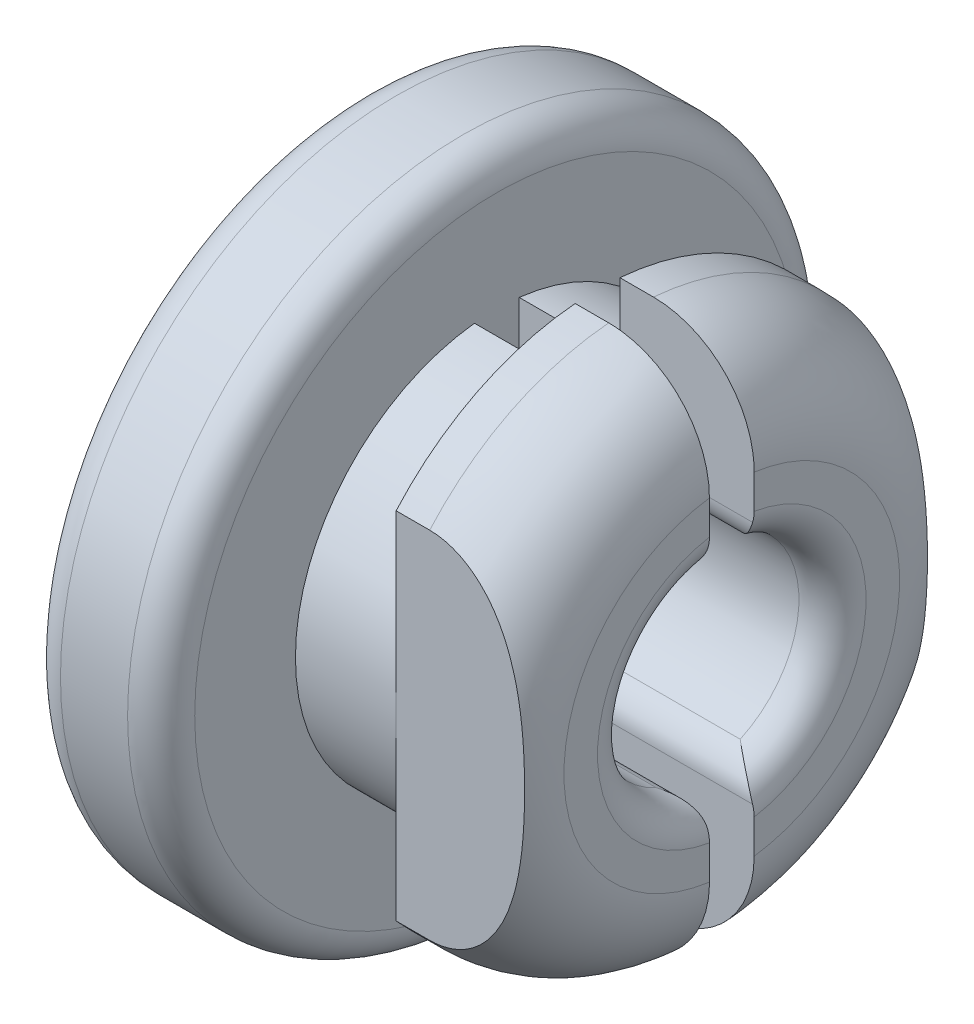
ISO-10303-21;
HEADER;
FILE_DESCRIPTION(('STEP AP214'),'2;1');
FILE_NAME('part.step','',(''),(''),'','','');
FILE_SCHEMA(('AUTOMOTIVE_DESIGN { 1 0 10303 214 1 1 1 1 }'));
ENDSEC;
DATA;
#1=APPLICATION_CONTEXT('core data for automotive mechanical design processes');
#2=APPLICATION_PROTOCOL_DEFINITION('international standard','automotive_design',2000,#1);
#3=PRODUCT_CONTEXT('',#1,'mechanical');
#4=PRODUCT('Part','Part','',(#3));
#5=PRODUCT_RELATED_PRODUCT_CATEGORY('part','',(#4));
#6=PRODUCT_DEFINITION_FORMATION('','',#4);
#7=PRODUCT_DEFINITION_CONTEXT('part definition',#1,'design');
#8=PRODUCT_DEFINITION('design','',#6,#7);
#9=PRODUCT_DEFINITION_SHAPE('','',#8);
#10=(LENGTH_UNIT() NAMED_UNIT(*) SI_UNIT(.MILLI.,.METRE.));
#11=(NAMED_UNIT(*) PLANE_ANGLE_UNIT() SI_UNIT($,.RADIAN.));
#12=(NAMED_UNIT(*) SI_UNIT($,.STERADIAN.) SOLID_ANGLE_UNIT());
#13=UNCERTAINTY_MEASURE_WITH_UNIT(LENGTH_MEASURE(1.E-05),#10,'distance_accuracy_value','');
#14=(GEOMETRIC_REPRESENTATION_CONTEXT(3) GLOBAL_UNCERTAINTY_ASSIGNED_CONTEXT((#13)) GLOBAL_UNIT_ASSIGNED_CONTEXT((#10,
#11,#12)) REPRESENTATION_CONTEXT('',''));
#15=CARTESIAN_POINT('',(0.,0.,0.));
#16=DIRECTION('',(0.,0.,1.));
#17=DIRECTION('',(1.,0.,0.));
#18=AXIS2_PLACEMENT_3D('',#15,#16,#17);
#19=CARTESIAN_POINT('',(7.,6.,0.));
#20=DIRECTION('',(1.,0.,0.));
#21=DIRECTION('',(0.,0.,-1.));
#22=AXIS2_PLACEMENT_3D('',#19,#20,#21);
#23=PLANE('',#22);
#24=CARTESIAN_POINT('',(7.,0.,0.));
#25=DIRECTION('',(-1.,0.,0.));
#26=DIRECTION('',(0.,0.,1.));
#27=AXIS2_PLACEMENT_3D('',#24,#25,#26);
#28=CIRCLE('',#27,8.);
#29=CARTESIAN_POINT('',(7.,-7.97220393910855,0.666306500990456));
#30=VERTEX_POINT('',#29);
#31=CARTESIAN_POINT('',(7.,-5.29150262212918,6.));
#32=VERTEX_POINT('',#31);
#33=EDGE_CURVE('E258',#30,#32,#28,.T.);
#34=ORIENTED_EDGE('',*,*,#33,.T.);
#35=DIRECTION('',(0.,1.,0.));
#36=VECTOR('',#35,1.);
#37=CARTESIAN_POINT('',(7.,6.,6.));
#38=LINE('',#37,#36);
#39=CARTESIAN_POINT('',(7.,0.,6.));
#40=VERTEX_POINT('',#39);
#41=EDGE_CURVE('E485',#32,#40,#38,.T.);
#42=ORIENTED_EDGE('',*,*,#41,.T.);
#43=CARTESIAN_POINT('',(7.,0.,0.));
#44=DIRECTION('',(-1.,0.,0.));
#45=DIRECTION('',(0.,0.,1.));
#46=AXIS2_PLACEMENT_3D('',#43,#44,#45);
#47=CIRCLE('',#46,6.);
#48=CARTESIAN_POINT('',(7.,-5.96288819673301,0.666306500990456));
#49=VERTEX_POINT('',#48);
#50=EDGE_CURVE('E277',#49,#40,#47,.T.);
#51=ORIENTED_EDGE('',*,*,#50,.F.);
#52=DIRECTION('',(0.,-1.,0.));
#53=VECTOR('',#52,1.);
#54=CARTESIAN_POINT('',(7.,6.,0.666306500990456));
#55=LINE('',#54,#53);
#56=EDGE_CURVE('E483',#49,#30,#55,.T.);
#57=ORIENTED_EDGE('',*,*,#56,.T.);
#58=EDGE_LOOP('',(#34,#42,#51,#57));
#59=FACE_BOUND('',#58,.T.);
#60=ADVANCED_FACE('F31',(#59),#23,.F.);
#61=CARTESIAN_POINT('',(0.,0.,0.));
#62=DIRECTION('',(-1.,0.,0.));
#63=DIRECTION('',(0.,0.,1.));
#64=AXIS2_PLACEMENT_3D('',#61,#62,#63);
#65=CYLINDRICAL_SURFACE('',#64,8.);
#66=CARTESIAN_POINT('',(7.99999999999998,0.,0.));
#67=DIRECTION('',(-1.,0.,0.));
#68=DIRECTION('',(0.,0.,1.));
#69=AXIS2_PLACEMENT_3D('',#66,#67,#68);
#70=CIRCLE('',#69,8.);
#71=CARTESIAN_POINT('',(7.99999999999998,-7.97220393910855,0.666306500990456));
#72=VERTEX_POINT('',#71);
#73=CARTESIAN_POINT('',(7.99999999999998,-5.29150262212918,6.));
#74=VERTEX_POINT('',#73);
#75=EDGE_CURVE('E239',#72,#74,#70,.T.);
#76=ORIENTED_EDGE('',*,*,#75,.T.);
#77=DIRECTION('',(-1.,0.,0.));
#78=VECTOR('',#77,1.);
#79=CARTESIAN_POINT('',(0.,-5.29150262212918,6.));
#80=LINE('',#79,#78);
#81=EDGE_CURVE('E220',#74,#32,#80,.T.);
#82=ORIENTED_EDGE('',*,*,#81,.T.);
#83=ORIENTED_EDGE('',*,*,#33,.F.);
#84=DIRECTION('',(-1.,0.,0.));
#85=VECTOR('',#84,1.);
#86=CARTESIAN_POINT('',(0.,-7.97220393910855,0.666306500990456));
#87=LINE('',#86,#85);
#88=EDGE_CURVE('E523',#30,#72,#87,.F.);
#89=ORIENTED_EDGE('',*,*,#88,.T.);
#90=EDGE_LOOP('',(#76,#82,#83,#89));
#91=FACE_BOUND('',#90,.T.);
#92=ADVANCED_FACE('F447',(#91),#65,.T.);
#93=CARTESIAN_POINT('',(7.,7.97220393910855,-0.666306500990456));
#94=VERTEX_POINT('',#93);
#95=CARTESIAN_POINT('',(7.,5.29150262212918,-6.));
#96=VERTEX_POINT('',#95);
#97=EDGE_CURVE('E264',#94,#96,#28,.T.);
#98=ORIENTED_EDGE('',*,*,#97,.T.);
#99=DIRECTION('',(0.,-1.,0.));
#100=VECTOR('',#99,1.);
#101=CARTESIAN_POINT('',(7.,6.,-6.));
#102=LINE('',#101,#100);
#103=CARTESIAN_POINT('',(7.,0.,-6.));
#104=VERTEX_POINT('',#103);
#105=EDGE_CURVE('E494',#96,#104,#102,.T.);
#106=ORIENTED_EDGE('',*,*,#105,.T.);
#107=CARTESIAN_POINT('',(7.,5.96288819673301,-0.666306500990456));
#108=VERTEX_POINT('',#107);
#109=EDGE_CURVE('E284',#108,#104,#47,.T.);
#110=ORIENTED_EDGE('',*,*,#109,.F.);
#111=DIRECTION('',(0.,1.,0.));
#112=VECTOR('',#111,1.);
#113=CARTESIAN_POINT('',(7.,6.,-0.666306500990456));
#114=LINE('',#113,#112);
#115=EDGE_CURVE('E509',#108,#94,#114,.T.);
#116=ORIENTED_EDGE('',*,*,#115,.T.);
#117=EDGE_LOOP('',(#98,#106,#110,#116));
#118=FACE_BOUND('',#117,.T.);
#119=ADVANCED_FACE('F450',(#118),#23,.F.);
#120=CARTESIAN_POINT('',(7.99999999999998,7.97220393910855,-0.666306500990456));
#121=VERTEX_POINT('',#120);
#122=CARTESIAN_POINT('',(7.99999999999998,5.29150262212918,-6.));
#123=VERTEX_POINT('',#122);
#124=EDGE_CURVE('E243',#121,#123,#70,.T.);
#125=ORIENTED_EDGE('',*,*,#124,.T.);
#126=DIRECTION('',(-1.,0.,0.));
#127=VECTOR('',#126,1.);
#128=CARTESIAN_POINT('',(0.,5.29150262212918,-6.));
#129=LINE('',#128,#127);
#130=EDGE_CURVE('E488',#123,#96,#129,.T.);
#131=ORIENTED_EDGE('',*,*,#130,.T.);
#132=ORIENTED_EDGE('',*,*,#97,.F.);
#133=DIRECTION('',(-1.,0.,0.));
#134=VECTOR('',#133,1.);
#135=CARTESIAN_POINT('',(0.,7.97220393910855,-0.666306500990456));
#136=LINE('',#135,#134);
#137=EDGE_CURVE('E507',#94,#121,#136,.F.);
#138=ORIENTED_EDGE('',*,*,#137,.T.);
#139=EDGE_LOOP('',(#125,#131,#132,#138));
#140=FACE_BOUND('',#139,.T.);
#141=ADVANCED_FACE('F456',(#140),#65,.T.);
#142=CARTESIAN_POINT('',(11.,4.99999999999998,0.));
#143=DIRECTION('',(-1.,0.,0.));
#144=DIRECTION('',(0.,0.,1.));
#145=AXIS2_PLACEMENT_3D('',#142,#143,#144);
#146=PLANE('',#145);
#147=DIRECTION('',(0.,-1.,0.));
#148=VECTOR('',#147,1.);
#149=CARTESIAN_POINT('',(11.,11.4098428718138,0.666306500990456));
#150=LINE('',#149,#148);
#151=CARTESIAN_POINT('',(11.,-3.94411405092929,0.666306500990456));
#152=VERTEX_POINT('',#151);
#153=CARTESIAN_POINT('',(11.,-4.95540469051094,0.666306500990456));
#154=VERTEX_POINT('',#153);
#155=EDGE_CURVE('E499',#152,#154,#150,.T.);
#156=ORIENTED_EDGE('',*,*,#155,.F.);
#157=CARTESIAN_POINT('',(11.,0.,0.));
#158=DIRECTION('',(-1.,0.,0.));
#159=DIRECTION('',(0.,0.,1.));
#160=AXIS2_PLACEMENT_3D('',#157,#158,#159);
#161=CIRCLE('',#160,4.);
#162=CARTESIAN_POINT('',(11.,3.94411405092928,0.666306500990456));
#163=VERTEX_POINT('',#162);
#164=EDGE_CURVE('E534',#152,#163,#161,.T.);
#165=ORIENTED_EDGE('',*,*,#164,.T.);
#166=CARTESIAN_POINT('',(11.,4.95540469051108,0.666306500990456));
#167=VERTEX_POINT('',#166);
#168=EDGE_CURVE('E498',#167,#163,#150,.T.);
#169=ORIENTED_EDGE('',*,*,#168,.F.);
#170=CARTESIAN_POINT('',(11.,0.,0.));
#171=DIRECTION('',(-1.,0.,0.));
#172=DIRECTION('',(0.,0.,1.));
#173=AXIS2_PLACEMENT_3D('',#170,#171,#172);
#174=CIRCLE('',#173,4.99999999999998);
#175=EDGE_CURVE('E245',#154,#167,#174,.T.);
#176=ORIENTED_EDGE('',*,*,#175,.F.);
#177=EDGE_LOOP('',(#156,#165,#169,#176));
#178=FACE_BOUND('',#177,.T.);
#179=ADVANCED_FACE('F474',(#178),#146,.F.);
#180=CARTESIAN_POINT('',(0.,0.,0.));
#181=DIRECTION('',(-1.,0.,0.));
#182=DIRECTION('',(0.,0.,1.));
#183=AXIS2_PLACEMENT_3D('',#180,#181,#182);
#184=CYLINDRICAL_SURFACE('',#183,6.);
#185=ORIENTED_EDGE('',*,*,#50,.T.);
#186=CARTESIAN_POINT('',(7.,5.96288819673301,0.666306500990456));
#187=VERTEX_POINT('',#186);
#188=EDGE_CURVE('E272',#40,#187,#47,.T.);
#189=ORIENTED_EDGE('',*,*,#188,.T.);
#190=DIRECTION('',(-1.,0.,0.));
#191=VECTOR('',#190,1.);
#192=CARTESIAN_POINT('',(0.,5.96288819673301,0.666306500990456));
#193=LINE('',#192,#191);
#194=CARTESIAN_POINT('',(4.,5.96288819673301,0.666306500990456));
#195=VERTEX_POINT('',#194);
#196=EDGE_CURVE('E521',#187,#195,#193,.T.);
#197=ORIENTED_EDGE('',*,*,#196,.T.);
#198=CARTESIAN_POINT('',(4.,0.,0.));
#199=DIRECTION('',(-1.,0.,0.));
#200=DIRECTION('',(0.,0.,1.));
#201=AXIS2_PLACEMENT_3D('',#198,#199,#200);
#202=CIRCLE('',#201,6.);
#203=CARTESIAN_POINT('',(4.,-5.96288819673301,0.666306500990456));
#204=VERTEX_POINT('',#203);
#205=EDGE_CURVE('E291',#204,#195,#202,.T.);
#206=ORIENTED_EDGE('',*,*,#205,.F.);
#207=DIRECTION('',(-1.,0.,0.));
#208=VECTOR('',#207,1.);
#209=CARTESIAN_POINT('',(0.,-5.96288819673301,0.666306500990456));
#210=LINE('',#209,#208);
#211=EDGE_CURVE('E480',#204,#49,#210,.F.);
#212=ORIENTED_EDGE('',*,*,#211,.T.);
#213=EDGE_LOOP('',(#185,#189,#197,#206,#212));
#214=FACE_BOUND('',#213,.T.);
#215=ADVANCED_FACE('F468',(#214),#184,.T.);
#216=ORIENTED_EDGE('',*,*,#188,.F.);
#217=CARTESIAN_POINT('',(7.,5.29150262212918,6.));
#218=VERTEX_POINT('',#217);
#219=EDGE_CURVE('E475',#40,#218,#38,.T.);
#220=ORIENTED_EDGE('',*,*,#219,.T.);
#221=CARTESIAN_POINT('',(7.,7.97220393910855,0.666306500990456));
#222=VERTEX_POINT('',#221);
#223=EDGE_CURVE('E233',#218,#222,#28,.T.);
#224=ORIENTED_EDGE('',*,*,#223,.T.);
#225=EDGE_CURVE('E476',#222,#187,#55,.T.);
#226=ORIENTED_EDGE('',*,*,#225,.T.);
#227=EDGE_LOOP('',(#216,#220,#224,#226));
#228=FACE_BOUND('',#227,.T.);
#229=ADVANCED_FACE('F460',(#228),#23,.F.);
#230=ORIENTED_EDGE('',*,*,#223,.F.);
#231=DIRECTION('',(-1.,0.,0.));
#232=VECTOR('',#231,1.);
#233=CARTESIAN_POINT('',(0.,5.29150262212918,6.));
#234=LINE('',#233,#232);
#235=CARTESIAN_POINT('',(7.99999999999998,5.29150262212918,6.));
#236=VERTEX_POINT('',#235);
#237=EDGE_CURVE('E217',#218,#236,#234,.F.);
#238=ORIENTED_EDGE('',*,*,#237,.T.);
#239=CARTESIAN_POINT('',(7.99999999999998,7.97220393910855,0.666306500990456));
#240=VERTEX_POINT('',#239);
#241=EDGE_CURVE('E231',#236,#240,#70,.T.);
#242=ORIENTED_EDGE('',*,*,#241,.T.);
#243=DIRECTION('',(-1.,0.,0.));
#244=VECTOR('',#243,1.);
#245=CARTESIAN_POINT('',(0.,7.97220393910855,0.666306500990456));
#246=LINE('',#245,#244);
#247=EDGE_CURVE('E518',#240,#222,#246,.T.);
#248=ORIENTED_EDGE('',*,*,#247,.T.);
#249=EDGE_LOOP('',(#230,#238,#242,#248));
#250=FACE_BOUND('',#249,.T.);
#251=ADVANCED_FACE('F229',(#250),#65,.T.);
#252=CARTESIAN_POINT('',(8.,0.,0.));
#253=DIRECTION('',(-1.,0.,0.));
#254=DIRECTION('',(0.,0.,1.));
#255=AXIS2_PLACEMENT_3D('',#252,#253,#254);
#256=TOROIDAL_SURFACE('',#255,5.,3.);
#257=ORIENTED_EDGE('',*,*,#241,.F.);
#258=CARTESIAN_POINT('',(10.7899132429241,-1.11595902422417,6.));
#259=CARTESIAN_POINT('',(10.7771673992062,-1.29230771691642,6.));
#260=CARTESIAN_POINT('',(10.7608957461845,-1.46841366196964,6.));
#261=CARTESIAN_POINT('',(10.7195269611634,-1.8196755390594,6.));
#262=CARTESIAN_POINT('',(10.6944271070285,-1.99483116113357,6.));
#263=CARTESIAN_POINT('',(10.6332295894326,-2.34228156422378,6.));
#264=CARTESIAN_POINT('',(10.5971929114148,-2.51458675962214,6.));
#265=CARTESIAN_POINT('',(10.5113614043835,-2.8556737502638,6.));
#266=CARTESIAN_POINT('',(10.4615777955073,-3.02445829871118,6.));
#267=CARTESIAN_POINT('',(10.3412641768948,-3.36749952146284,6.));
#268=CARTESIAN_POINT('',(10.2695593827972,-3.54135502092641,6.));
#269=CARTESIAN_POINT('',(10.1031658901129,-3.87808297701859,6.));
#270=CARTESIAN_POINT('',(10.0084736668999,-4.04095374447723,6.));
#271=CARTESIAN_POINT('',(9.81216530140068,-4.32153784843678,6.));
#272=CARTESIAN_POINT('',(9.71472911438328,-4.44214522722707,6.));
#273=CARTESIAN_POINT('',(9.50156074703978,-4.66598065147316,6.));
#274=CARTESIAN_POINT('',(9.38585778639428,-4.7692359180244,6.));
#275=CARTESIAN_POINT('',(9.16173007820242,-4.93426334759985,6.));
#276=CARTESIAN_POINT('',(9.05638262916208,-5.00020085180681,6.));
#277=CARTESIAN_POINT('',(8.8361686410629,-5.11376486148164,6.));
#278=CARTESIAN_POINT('',(8.72130595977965,-5.16139874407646,6.));
#279=CARTESIAN_POINT('',(8.48423024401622,-5.2356938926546,6.));
#280=CARTESIAN_POINT('',(8.3619809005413,-5.26224063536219,6.));
#281=CARTESIAN_POINT('',(8.11466923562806,-5.29207347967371,6.));
#282=CARTESIAN_POINT('',(7.98960788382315,-5.29536747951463,6.));
#283=CARTESIAN_POINT('',(7.75253364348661,-5.27927081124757,6.));
#284=CARTESIAN_POINT('',(7.6403750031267,-5.26193076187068,6.));
#285=CARTESIAN_POINT('',(7.42051982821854,-5.20893850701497,6.));
#286=CARTESIAN_POINT('',(7.31282282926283,-5.1732882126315,6.));
#287=CARTESIAN_POINT('',(7.10269940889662,-5.08485709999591,6.));
#288=CARTESIAN_POINT('',(7.00038750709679,-5.03180653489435,6.));
#289=CARTESIAN_POINT('',(6.80468860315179,-4.91125905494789,6.));
#290=CARTESIAN_POINT('',(6.71130765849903,-4.84375243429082,6.));
#291=CARTESIAN_POINT('',(6.49667262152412,-4.66552853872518,6.));
#292=CARTESIAN_POINT('',(6.3805143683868,-4.54866084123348,6.));
#293=CARTESIAN_POINT('',(6.16872411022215,-4.29780449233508,6.));
#294=CARTESIAN_POINT('',(6.07311893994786,-4.16379381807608,6.));
#295=CARTESIAN_POINT('',(5.85865413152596,-3.81534367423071,6.));
#296=CARTESIAN_POINT('',(5.75145620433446,-3.59374361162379,6.));
#297=CARTESIAN_POINT('',(5.61679451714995,-3.251379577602,6.));
#298=CARTESIAN_POINT('',(5.57620139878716,-3.13532473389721,6.));
#299=CARTESIAN_POINT('',(5.50269935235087,-2.90080789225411,6.));
#300=CARTESIAN_POINT('',(5.46978810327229,-2.78234663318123,6.));
#301=CARTESIAN_POINT('',(5.4012725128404,-2.50602540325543,6.));
#302=CARTESIAN_POINT('',(5.36811574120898,-2.34756843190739,6.));
#303=CARTESIAN_POINT('',(5.31121380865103,-2.02894213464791,6.));
#304=CARTESIAN_POINT('',(5.28747315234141,-1.86877202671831,6.));
#305=CARTESIAN_POINT('',(5.2475590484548,-1.54714170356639,6.));
#306=CARTESIAN_POINT('',(5.23140319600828,-1.38567936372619,6.));
#307=CARTESIAN_POINT('',(5.20529428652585,-1.06229631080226,6.));
#308=CARTESIAN_POINT('',(5.19534023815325,-0.900375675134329,6.));
#309=CARTESIAN_POINT('',(5.18060996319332,-0.57592357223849,6.));
#310=CARTESIAN_POINT('',(5.17584603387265,-0.413391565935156,6.));
#311=CARTESIAN_POINT('',(5.17101607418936,-0.0882483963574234,6.));
#312=CARTESIAN_POINT('',(5.17095038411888,0.0743627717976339,6.));
#313=CARTESIAN_POINT('',(5.17550760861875,0.399282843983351,6.));
#314=CARTESIAN_POINT('',(5.18012365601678,0.561591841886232,6.));
#315=CARTESIAN_POINT('',(5.19453583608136,0.885966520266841,6.));
#316=CARTESIAN_POINT('',(5.20433120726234,1.04803223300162,6.));
#317=CARTESIAN_POINT('',(5.2275179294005,1.33924629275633,6.));
#318=CARTESIAN_POINT('',(5.23979516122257,1.46848226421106,6.));
#319=CARTESIAN_POINT('',(5.26902006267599,1.72644735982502,6.));
#320=CARTESIAN_POINT('',(5.28596816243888,1.85517643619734,6.));
#321=CARTESIAN_POINT('',(5.32539362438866,2.11168300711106,6.));
#322=CARTESIAN_POINT('',(5.34786600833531,2.23946125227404,6.));
#323=CARTESIAN_POINT('',(5.39936165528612,2.49369899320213,6.));
#324=CARTESIAN_POINT('',(5.42838466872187,2.62015853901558,6.));
#325=CARTESIAN_POINT('',(5.49461829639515,2.87296469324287,6.));
#326=CARTESIAN_POINT('',(5.53194323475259,2.999282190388,6.));
#327=CARTESIAN_POINT('',(5.61574822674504,3.24881148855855,6.));
#328=CARTESIAN_POINT('',(5.66223048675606,3.37202253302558,6.));
#329=CARTESIAN_POINT('',(5.81724384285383,3.73446480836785,6.));
#330=CARTESIAN_POINT('',(5.94160406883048,3.96761802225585,6.));
#331=CARTESIAN_POINT('',(6.17415279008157,4.30300232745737,6.));
#332=CARTESIAN_POINT('',(6.26494413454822,4.4173502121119,6.));
#333=CARTESIAN_POINT('',(6.46283808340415,4.63118945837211,6.));
#334=CARTESIAN_POINT('',(6.5699367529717,4.73068439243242,6.));
#335=CARTESIAN_POINT('',(6.80109149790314,4.91068676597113,6.));
#336=CARTESIAN_POINT('',(6.92531393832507,4.9909836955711,6.));
#337=CARTESIAN_POINT('',(7.18718799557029,5.12558427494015,6.));
#338=CARTESIAN_POINT('',(7.32482326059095,5.17991910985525,6.));
#339=CARTESIAN_POINT('',(7.58931313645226,5.25274069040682,6.));
#340=CARTESIAN_POINT('',(7.7151072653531,5.27508265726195,6.));
#341=CARTESIAN_POINT('',(7.96863273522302,5.29530821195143,6.));
#342=CARTESIAN_POINT('',(8.09636285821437,5.29320658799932,6.));
#343=CARTESIAN_POINT('',(8.33457413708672,5.26638240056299,6.));
#344=CARTESIAN_POINT('',(8.44536088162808,5.24426751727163,6.));
#345=CARTESIAN_POINT('',(8.6618076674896,5.18230654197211,6.));
#346=CARTESIAN_POINT('',(8.76746823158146,5.1424622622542,6.));
#347=CARTESIAN_POINT('',(8.97464480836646,5.04554339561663,6.));
#348=CARTESIAN_POINT('',(9.07592010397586,4.98795838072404,6.));
#349=CARTESIAN_POINT('',(9.26902320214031,4.85872116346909,6.));
#350=CARTESIAN_POINT('',(9.36084461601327,4.78705954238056,6.));
#351=CARTESIAN_POINT('',(9.57423473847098,4.59665175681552,6.));
#352=CARTESIAN_POINT('',(9.69002965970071,4.47141999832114,6.));
#353=CARTESIAN_POINT('',(9.89986420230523,4.20405826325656,6.));
#354=CARTESIAN_POINT('',(9.99386961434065,4.06190223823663,6.));
#355=CARTESIAN_POINT('',(10.2063302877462,3.68847624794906,6.));
#356=CARTESIAN_POINT('',(10.3115739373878,3.44971485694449,6.));
#357=CARTESIAN_POINT('',(10.4417250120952,3.0821812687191,6.));
#358=CARTESIAN_POINT('',(10.4805405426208,2.95784034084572,6.));
#359=CARTESIAN_POINT('',(10.5501572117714,2.70692556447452,6.));
#360=CARTESIAN_POINT('',(10.580960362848,2.58035228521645,6.));
#361=CARTESIAN_POINT('',(10.6396446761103,2.30745996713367,6.));
#362=CARTESIAN_POINT('',(10.6664684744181,2.16091913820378,6.));
#363=CARTESIAN_POINT('',(10.7127315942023,1.86665545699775,6.));
#364=CARTESIAN_POINT('',(10.7321687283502,1.71893226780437,6.));
#365=CARTESIAN_POINT('',(10.7649980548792,1.42260116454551,6.));
#366=CARTESIAN_POINT('',(10.7783808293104,1.27399223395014,6.));
#367=CARTESIAN_POINT('',(10.8001014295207,0.97643097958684,6.));
#368=CARTESIAN_POINT('',(10.8084397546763,0.827478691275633,6.));
#369=CARTESIAN_POINT('',(10.8208160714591,0.528869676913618,6.));
#370=CARTESIAN_POINT('',(10.8248386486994,0.379212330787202,6.));
#371=CARTESIAN_POINT('',(10.828904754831,0.0798388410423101,6.));
#372=CARTESIAN_POINT('',(10.8289481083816,-0.0698773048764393,6.));
#373=CARTESIAN_POINT('',(10.8250618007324,-0.36910965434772,6.));
#374=CARTESIAN_POINT('',(10.8211361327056,-0.518625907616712,6.));
#375=CARTESIAN_POINT('',(10.8089519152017,-0.817472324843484,6.));
#376=CARTESIAN_POINT('',(10.8006937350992,-0.966802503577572,6.));
#377=CARTESIAN_POINT('',(10.7899132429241,-1.11595902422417,6.));
#378=B_SPLINE_CURVE_WITH_KNOTS('',3,(#258,#259,#260,#261,#262,#263,#264,#265,#266,#267,#268,
#269,#270,#271,#272,#273,#274,#275,#276,#277,#278,#279,#280,#281,#282,#283,#284,#285,#286,#287,
#288,#289,#290,#291,#292,#293,#294,#295,#296,#297,#298,#299,#300,#301,#302,#303,#304,#305,#306,
#307,#308,#309,#310,#311,#312,#313,#314,#315,#316,#317,#318,#319,#320,#321,#322,#323,#324,#325,
#326,#327,#328,#329,#330,#331,#332,#333,#334,#335,#336,#337,#338,#339,#340,#341,#342,#343,#344,
#345,#346,#347,#348,#349,#350,#351,#352,#353,#354,#355,#356,#357,#358,#359,#360,#361,#362,#363,
#364,#365,#366,#367,#368,#369,#370,#371,#372,#373,#374,#375,#376,#377),.UNSPECIFIED.,.T.,.F.,(4,
2,2,2,2,2,2,2,2,2,2,2,2,2,2,2,2,2,2,2,2,2,2,2,2,2,2,2,2,2,2,2,2,2,2,2,2,2,2,2,2,2,2,2,2,2,2,2,2,
2,2,2,2,2,2,2,2,2,2,4),(0.,0.530392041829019,1.06094777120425,1.58859776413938,2.11581835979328,
2.678672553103,3.24161310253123,3.70508297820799,4.16781885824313,4.53914505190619,
4.91032142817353,5.28350012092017,5.65655205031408,5.99542665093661,6.3342658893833,
6.67862802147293,7.02322208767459,7.51476910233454,8.00695405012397,8.74101815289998,
9.10971561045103,9.47830152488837,9.96360865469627,10.4491476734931,10.9358075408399,
11.4223895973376,11.910122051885,12.3978898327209,12.8849431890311,13.3719249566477,
13.7613090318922,14.1507289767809,14.5397992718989,14.9288547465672,15.3236419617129,
15.718524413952,16.5048917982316,16.9415992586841,17.3782015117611,17.8193916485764,
18.2600504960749,18.6410958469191,19.0219106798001,19.3592865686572,19.6966279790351,
20.0447610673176,20.3931278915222,20.9019223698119,21.4115103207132,22.1895736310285,
22.580209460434,22.9707470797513,23.4174513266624,23.8642877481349,24.311816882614,
24.7593017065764,25.2083795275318,25.6574771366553,26.1061233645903,26.5547313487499),.UNSPECIFIED.);
#379=EDGE_CURVE('E214',#236,#74,#378,.T.);
#380=ORIENTED_EDGE('',*,*,#379,.T.);
#381=ORIENTED_EDGE('',*,*,#75,.F.);
#382=CARTESIAN_POINT('',(9.04108501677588,-7.78510224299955,0.666306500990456));
#383=CARTESIAN_POINT('',(9.19893940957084,-7.72647069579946,0.666306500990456));
#384=CARTESIAN_POINT('',(9.3519505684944,-7.65443814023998,0.666306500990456));
#385=CARTESIAN_POINT('',(9.64381882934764,-7.48562004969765,0.666306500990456));
#386=CARTESIAN_POINT('',(9.78265817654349,-7.38880398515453,0.666306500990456));
#387=CARTESIAN_POINT('',(10.0420447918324,-7.17329571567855,0.666306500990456));
#388=CARTESIAN_POINT('',(10.1626032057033,-7.05461693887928,0.666306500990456));
#389=CARTESIAN_POINT('',(10.3821074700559,-6.7987826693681,0.666306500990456));
#390=CARTESIAN_POINT('',(10.4810587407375,-6.66163182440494,0.666306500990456));
#391=CARTESIAN_POINT('',(10.6548960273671,-6.37235100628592,0.666306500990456));
#392=CARTESIAN_POINT('',(10.729717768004,-6.22018241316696,0.666306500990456));
#393=CARTESIAN_POINT('',(10.8529167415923,-5.90548978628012,0.666306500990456));
#394=CARTESIAN_POINT('',(10.9012923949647,-5.74296513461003,0.666306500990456));
#395=CARTESIAN_POINT('',(10.9705509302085,-5.41118519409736,0.666306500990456));
#396=CARTESIAN_POINT('',(10.9912738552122,-5.24189653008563,0.666306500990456));
#397=CARTESIAN_POINT('',(11.0042666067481,-4.90223555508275,0.666306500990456));
#398=CARTESIAN_POINT('',(10.996535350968,-4.7318632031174,0.666306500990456));
#399=CARTESIAN_POINT('',(10.9527992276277,-4.39325660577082,0.666306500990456));
#400=CARTESIAN_POINT('',(10.916544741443,-4.22505462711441,0.666306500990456));
#401=CARTESIAN_POINT('',(10.8166396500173,-3.89699896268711,0.666306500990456));
#402=CARTESIAN_POINT('',(10.7529876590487,-3.7371456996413,0.666306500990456));
#403=CARTESIAN_POINT('',(10.5993019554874,-3.42834884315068,0.666306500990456));
#404=CARTESIAN_POINT('',(10.508971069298,-3.27955314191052,0.666306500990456));
#405=CARTESIAN_POINT('',(10.3048141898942,-2.99903705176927,0.666306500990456));
#406=CARTESIAN_POINT('',(10.1909847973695,-2.867319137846,0.666306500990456));
#407=CARTESIAN_POINT('',(9.94188735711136,-2.62364693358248,0.666306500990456));
#408=CARTESIAN_POINT('',(9.80644375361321,-2.51187190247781,0.666306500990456));
#409=CARTESIAN_POINT('',(9.51847553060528,-2.31298991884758,0.666306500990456));
#410=CARTESIAN_POINT('',(9.36595077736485,-2.22588315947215,0.666306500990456));
#411=CARTESIAN_POINT('',(9.05034482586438,-2.08069915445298,0.666306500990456));
#412=CARTESIAN_POINT('',(8.88745275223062,-2.0222122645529,0.666306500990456));
#413=CARTESIAN_POINT('',(8.55389808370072,-1.93513360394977,0.666306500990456));
#414=CARTESIAN_POINT('',(8.38324022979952,-1.90652384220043,0.666306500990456));
#415=CARTESIAN_POINT('',(8.04851411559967,-1.88145281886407,0.666306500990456));
#416=CARTESIAN_POINT('',(7.88456405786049,-1.8833987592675,0.666306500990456));
#417=CARTESIAN_POINT('',(7.55944945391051,-1.91546080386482,0.666306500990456));
#418=CARTESIAN_POINT('',(7.39828497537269,-1.9455775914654,0.666306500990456));
#419=CARTESIAN_POINT('',(7.08661612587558,-2.03154442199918,0.666306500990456));
#420=CARTESIAN_POINT('',(6.93596033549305,-2.08685014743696,0.666306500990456));
#421=CARTESIAN_POINT('',(6.64541805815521,-2.22080466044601,0.666306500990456));
#422=CARTESIAN_POINT('',(6.50553400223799,-2.29945869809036,0.666306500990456));
#423=CARTESIAN_POINT('',(6.23339125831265,-2.4818954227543,0.666306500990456));
#424=CARTESIAN_POINT('',(6.10181780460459,-2.58670049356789,0.666306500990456));
#425=CARTESIAN_POINT('',(5.85729435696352,-2.81615592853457,0.666306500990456));
#426=CARTESIAN_POINT('',(5.74434712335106,-2.94080922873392,0.666306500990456));
#427=CARTESIAN_POINT('',(5.53603533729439,-3.21176631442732,0.666306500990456));
#428=CARTESIAN_POINT('',(5.44150967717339,-3.35871636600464,0.666306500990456));
#429=CARTESIAN_POINT('',(5.27837909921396,-3.66637065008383,0.666306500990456));
#430=CARTESIAN_POINT('',(5.20977548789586,-3.82707557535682,0.666306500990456));
#431=CARTESIAN_POINT('',(5.10042433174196,-4.15824125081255,0.666306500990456));
#432=CARTESIAN_POINT('',(5.05975990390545,-4.32872948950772,0.666306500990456));
#433=CARTESIAN_POINT('',(5.00797832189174,-4.6741390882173,0.666306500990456));
#434=CARTESIAN_POINT('',(4.996859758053,-4.84906023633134,0.666306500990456));
#435=CARTESIAN_POINT('',(5.00462268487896,-5.19631522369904,0.666306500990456));
#436=CARTESIAN_POINT('',(5.0231761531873,-5.36865638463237,0.666306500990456));
#437=CARTESIAN_POINT('',(5.08928139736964,-5.70768686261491,0.666306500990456));
#438=CARTESIAN_POINT('',(5.13683155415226,-5.87437649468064,0.666306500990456));
#439=CARTESIAN_POINT('',(5.25898940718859,-6.19545107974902,0.666306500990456));
#440=CARTESIAN_POINT('',(5.33329751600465,-6.34995004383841,0.666306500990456));
#441=CARTESIAN_POINT('',(5.50699019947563,-6.6441444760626,0.666306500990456));
#442=CARTESIAN_POINT('',(5.60637373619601,-6.78384055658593,0.666306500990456));
#443=CARTESIAN_POINT('',(5.82655893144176,-7.04335087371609,0.666306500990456));
#444=CARTESIAN_POINT('',(5.94719169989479,-7.16330843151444,0.666306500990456));
#445=CARTESIAN_POINT('',(6.20696375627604,-7.38114495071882,0.666306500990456));
#446=CARTESIAN_POINT('',(6.34610178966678,-7.47902540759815,0.666306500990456));
#447=CARTESIAN_POINT('',(6.63820167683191,-7.64945389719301,0.666306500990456));
#448=CARTESIAN_POINT('',(6.79109309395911,-7.72212267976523,0.666306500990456));
#449=CARTESIAN_POINT('',(7.10697107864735,-7.84070158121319,0.666306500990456));
#450=CARTESIAN_POINT('',(7.26996003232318,-7.88660534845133,0.666306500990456));
#451=CARTESIAN_POINT('',(7.60097422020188,-7.95023634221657,0.666306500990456));
#452=CARTESIAN_POINT('',(7.768988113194,-7.96802276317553,0.666306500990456));
#453=CARTESIAN_POINT('',(8.10547098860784,-7.97506702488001,0.666306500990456));
#454=CARTESIAN_POINT('',(8.2739391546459,-7.9643600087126,0.666306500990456));
#455=CARTESIAN_POINT('',(8.54268793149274,-7.92436715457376,0.666306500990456));
#456=CARTESIAN_POINT('',(8.64434192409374,-7.90378080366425,0.666306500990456));
#457=CARTESIAN_POINT('',(8.84497031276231,-7.85218866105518,0.666306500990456));
#458=CARTESIAN_POINT('',(8.94394471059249,-7.82118287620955,0.666306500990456));
#459=CARTESIAN_POINT('',(9.04108501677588,-7.78510224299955,0.666306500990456));
#460=B_SPLINE_CURVE_WITH_KNOTS('',3,(#382,#383,#384,#385,#386,#387,#388,#389,#390,#391,#392,
#393,#394,#395,#396,#397,#398,#399,#400,#401,#402,#403,#404,#405,#406,#407,#408,#409,#410,#411,
#412,#413,#414,#415,#416,#417,#418,#419,#420,#421,#422,#423,#424,#425,#426,#427,#428,#429,#430,
#431,#432,#433,#434,#435,#436,#437,#438,#439,#440,#441,#442,#443,#444,#445,#446,#447,#448,#449,
#450,#451,#452,#453,#454,#455,#456,#457,#458,#459),.UNSPECIFIED.,.T.,.F.,(4,2,2,2,2,2,2,2,2,2,2,
2,2,2,2,2,2,2,2,2,2,2,2,2,2,2,2,2,2,2,2,2,2,2,2,2,2,2,4),(0.,0.504794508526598,1.01021386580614,
1.51532382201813,2.0203069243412,2.52662427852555,3.0329718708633,3.54223590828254,
4.05151931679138,4.565309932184,5.07912653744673,5.59889744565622,6.11874359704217,
6.64304980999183,7.16736012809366,7.68392874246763,8.20018611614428,8.68962576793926,
9.17907729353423,9.65842013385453,10.1378708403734,10.640265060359,11.1427336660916,
11.6644428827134,12.1861783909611,12.7094593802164,13.2327154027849,13.7502267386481,
14.2677091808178,14.7795692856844,15.2914082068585,15.79934884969,16.3072550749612,
16.8126939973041,17.3182528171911,17.8227458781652,18.3266169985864,18.6372572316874,
18.9478972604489),.UNSPECIFIED.);
#461=EDGE_CURVE('E528',#72,#154,#460,.T.);
#462=ORIENTED_EDGE('',*,*,#461,.T.);
#463=ORIENTED_EDGE('',*,*,#175,.T.);
#464=CARTESIAN_POINT('',(8.5355505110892,1.9367796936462,0.666306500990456));
#465=CARTESIAN_POINT('',(8.67986595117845,1.96447437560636,0.666306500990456));
#466=CARTESIAN_POINT('',(8.82209670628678,2.00329540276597,0.666306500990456));
#467=CARTESIAN_POINT('',(9.09923651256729,2.10176558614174,0.666306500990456));
#468=CARTESIAN_POINT('',(9.23413792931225,2.16143599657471,0.666306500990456));
#469=CARTESIAN_POINT('',(9.50967201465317,2.30823805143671,0.666306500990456));
#470=CARTESIAN_POINT('',(9.64899908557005,2.39783037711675,0.666306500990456));
#471=CARTESIAN_POINT('',(9.91152783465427,2.59814154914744,0.666306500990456));
#472=CARTESIAN_POINT('',(10.0347250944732,2.70886616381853,0.666306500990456));
#473=CARTESIAN_POINT('',(10.2672726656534,2.95400032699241,0.666306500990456));
#474=CARTESIAN_POINT('',(10.3757208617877,3.08926747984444,0.666306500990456));
#475=CARTESIAN_POINT('',(10.568705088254,3.37590148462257,0.666306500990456));
#476=CARTESIAN_POINT('',(10.6532400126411,3.52726908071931,0.666306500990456));
#477=CARTESIAN_POINT('',(10.796839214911,3.8439294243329,0.666306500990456));
#478=CARTESIAN_POINT('',(10.8555745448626,4.00937161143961,0.666306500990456));
#479=CARTESIAN_POINT('',(10.94416171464,4.34782354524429,0.666306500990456));
#480=CARTESIAN_POINT('',(10.9740139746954,4.52083318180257,0.666306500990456));
#481=CARTESIAN_POINT('',(11.0036540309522,4.86787229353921,0.666306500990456));
#482=CARTESIAN_POINT('',(11.003705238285,5.04187923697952,0.666306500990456));
#483=CARTESIAN_POINT('',(10.9742340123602,5.38737222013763,0.666306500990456));
#484=CARTESIAN_POINT('',(10.9447134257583,5.55885841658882,0.666306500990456));
#485=CARTESIAN_POINT('',(10.8573368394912,5.89233076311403,0.666306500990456));
#486=CARTESIAN_POINT('',(10.7998126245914,6.0544038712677,0.666306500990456));
#487=CARTESIAN_POINT('',(10.6581354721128,6.36646199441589,0.666306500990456));
#488=CARTESIAN_POINT('',(10.5739838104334,6.51644758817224,0.666306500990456));
#489=CARTESIAN_POINT('',(10.3822541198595,6.79870531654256,0.666306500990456));
#490=CARTESIAN_POINT('',(10.274885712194,6.93111986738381,0.666306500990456));
#491=CARTESIAN_POINT('',(10.0393290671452,7.17591589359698,0.666306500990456));
#492=CARTESIAN_POINT('',(9.91114150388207,7.2882980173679,0.666306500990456));
#493=CARTESIAN_POINT('',(9.63836657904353,7.48919439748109,0.666306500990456));
#494=CARTESIAN_POINT('',(9.49387464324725,7.57783824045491,0.666306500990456));
#495=CARTESIAN_POINT('',(9.19202303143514,7.72951888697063,0.666306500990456));
#496=CARTESIAN_POINT('',(9.03466360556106,7.79255618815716,0.666306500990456));
#497=CARTESIAN_POINT('',(8.71208900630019,7.89103987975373,0.666306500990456));
#498=CARTESIAN_POINT('',(8.54690064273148,7.92657409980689,0.666306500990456));
#499=CARTESIAN_POINT('',(8.21290133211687,7.9693621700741,0.666306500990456));
#500=CARTESIAN_POINT('',(8.04409042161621,7.97661630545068,0.666306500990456));
#501=CARTESIAN_POINT('',(7.70789037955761,7.96264537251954,0.666306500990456));
#502=CARTESIAN_POINT('',(7.54049958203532,7.94146035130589,0.666306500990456));
#503=CARTESIAN_POINT('',(7.21165067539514,7.87129120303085,0.666306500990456));
#504=CARTESIAN_POINT('',(7.05019255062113,7.82230714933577,0.666306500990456));
#505=CARTESIAN_POINT('',(6.73776360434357,7.6979395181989,0.666306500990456));
#506=CARTESIAN_POINT('',(6.5867941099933,7.62255260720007,0.666306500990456));
#507=CARTESIAN_POINT('',(6.29962704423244,7.44754334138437,0.666306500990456));
#508=CARTESIAN_POINT('',(6.16342953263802,7.34792088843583,0.666306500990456));
#509=CARTESIAN_POINT('',(5.90941544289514,7.1271042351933,0.666306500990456));
#510=CARTESIAN_POINT('',(5.79163006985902,7.00587414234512,0.666306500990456));
#511=CARTESIAN_POINT('',(5.57800040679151,6.74542081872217,0.666306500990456));
#512=CARTESIAN_POINT('',(5.48215638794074,6.60619736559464,0.666306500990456));
#513=CARTESIAN_POINT('',(5.31474711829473,6.31319641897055,0.666306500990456));
#514=CARTESIAN_POINT('',(5.24326872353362,6.1593693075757,0.666306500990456));
#515=CARTESIAN_POINT('',(5.12698398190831,5.84194862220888,0.666306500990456));
#516=CARTESIAN_POINT('',(5.08217817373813,5.67835485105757,0.666306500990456));
#517=CARTESIAN_POINT('',(5.02019335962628,5.34500867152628,0.666306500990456));
#518=CARTESIAN_POINT('',(5.00318052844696,5.17522537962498,0.666306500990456));
#519=CARTESIAN_POINT('',(4.99763189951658,4.83519811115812,0.666306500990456));
#520=CARTESIAN_POINT('',(5.00909734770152,4.66495411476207,0.666306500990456));
#521=CARTESIAN_POINT('',(5.06025872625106,4.32718621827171,0.666306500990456));
#522=CARTESIAN_POINT('',(5.10020957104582,4.1597009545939,0.666306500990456));
#523=CARTESIAN_POINT('',(5.20733418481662,3.83368047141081,0.666306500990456));
#524=CARTESIAN_POINT('',(5.27450935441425,3.67514571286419,0.666306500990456));
#525=CARTESIAN_POINT('',(5.4350244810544,3.36955403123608,0.666306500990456));
#526=CARTESIAN_POINT('',(5.52866087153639,3.22265279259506,0.666306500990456));
#527=CARTESIAN_POINT('',(5.73908049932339,2.9464625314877,0.666306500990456));
#528=CARTESIAN_POINT('',(5.85586688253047,2.81717590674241,0.666306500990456));
#529=CARTESIAN_POINT('',(6.1103985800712,2.57897832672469,0.666306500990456));
#530=CARTESIAN_POINT('',(6.24830042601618,2.47023435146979,0.666306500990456));
#531=CARTESIAN_POINT('',(6.54066111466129,2.27784764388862,0.666306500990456));
#532=CARTESIAN_POINT('',(6.6951219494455,2.19420793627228,0.666306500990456));
#533=CARTESIAN_POINT('',(7.01374205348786,2.05646373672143,0.666306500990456));
#534=CARTESIAN_POINT('',(7.17769230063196,2.00188219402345,0.666306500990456));
#535=CARTESIAN_POINT('',(7.42865986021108,1.94256932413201,0.666306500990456));
#536=CARTESIAN_POINT('',(7.51314372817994,1.92655894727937,0.666306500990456));
#537=CARTESIAN_POINT('',(7.68320352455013,1.90222494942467,0.666306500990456));
#538=CARTESIAN_POINT('',(7.76877913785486,1.89389915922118,0.666306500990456));
#539=CARTESIAN_POINT('',(7.9684687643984,1.88362630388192,0.666306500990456));
#540=CARTESIAN_POINT('',(8.08274852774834,1.88466214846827,0.666306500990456));
#541=CARTESIAN_POINT('',(8.3102874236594,1.90049362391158,0.666306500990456));
#542=CARTESIAN_POINT('',(8.42354680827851,1.91528575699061,0.666306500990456));
#543=CARTESIAN_POINT('',(8.5355505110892,1.9367796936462,0.666306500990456));
#544=B_SPLINE_CURVE_WITH_KNOTS('',3,(#464,#465,#466,#467,#468,#469,#470,#471,#472,#473,#474,
#475,#476,#477,#478,#479,#480,#481,#482,#483,#484,#485,#486,#487,#488,#489,#490,#491,#492,#493,
#494,#495,#496,#497,#498,#499,#500,#501,#502,#503,#504,#505,#506,#507,#508,#509,#510,#511,#512,
#513,#514,#515,#516,#517,#518,#519,#520,#521,#522,#523,#524,#525,#526,#527,#528,#529,#530,#531,
#532,#533,#534,#535,#536,#537,#538,#539,#540,#541,#542,#543),.UNSPECIFIED.,.T.,.F.,(4,2,2,2,2,2,
2,2,2,2,2,2,2,2,2,2,2,2,2,2,2,2,2,2,2,2,2,2,2,2,2,2,2,2,2,2,2,2,2,4),(0.,0.440517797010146,
0.881485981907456,1.376202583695,1.87105441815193,2.38875720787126,2.90648393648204,
3.43063261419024,3.95477366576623,4.47428177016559,4.99375743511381,5.50722290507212,
6.02066377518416,6.5296492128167,7.03861817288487,7.54474926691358,8.05087052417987,
8.55536876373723,9.05986191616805,9.56364540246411,10.0674275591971,10.5712733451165,
11.0751211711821,11.5798138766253,12.0845128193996,12.5909924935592,13.0974823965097,
13.6069896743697,14.1165192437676,14.6306667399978,15.1448406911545,15.665020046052,
16.1852701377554,16.709582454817,17.2339579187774,17.7494362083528,18.0071022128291,
18.2646954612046,18.606669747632,18.9485571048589),.UNSPECIFIED.);
#545=EDGE_CURVE('E238',#167,#240,#544,.T.);
#546=ORIENTED_EDGE('',*,*,#545,.T.);
#547=EDGE_LOOP('',(#257,#380,#381,#462,#463,#546));
#548=FACE_BOUND('',#547,.T.);
#549=ADVANCED_FACE('F236',(#548),#256,.T.);
#550=DIRECTION('',(0.,1.,0.));
#551=VECTOR('',#550,1.);
#552=CARTESIAN_POINT('',(11.,11.4098428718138,-0.666306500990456));
#553=LINE('',#552,#551);
#554=CARTESIAN_POINT('',(11.,3.94411405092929,-0.666306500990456));
#555=VERTEX_POINT('',#554);
#556=CARTESIAN_POINT('',(11.,4.95540469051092,-0.666306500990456));
#557=VERTEX_POINT('',#556);
#558=EDGE_CURVE('E495',#555,#557,#553,.T.);
#559=ORIENTED_EDGE('',*,*,#558,.F.);
#560=CARTESIAN_POINT('',(11.,0.,0.));
#561=DIRECTION('',(-1.,0.,0.));
#562=DIRECTION('',(0.,0.,1.));
#563=AXIS2_PLACEMENT_3D('',#560,#561,#562);
#564=CIRCLE('',#563,4.);
#565=CARTESIAN_POINT('',(11.,-3.94411405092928,-0.666306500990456));
#566=VERTEX_POINT('',#565);
#567=EDGE_CURVE('E568',#555,#566,#564,.T.);
#568=ORIENTED_EDGE('',*,*,#567,.T.);
#569=CARTESIAN_POINT('',(11.,-4.95540469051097,-0.666306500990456));
#570=VERTEX_POINT('',#569);
#571=EDGE_CURVE('E497',#570,#566,#553,.T.);
#572=ORIENTED_EDGE('',*,*,#571,.F.);
#573=EDGE_CURVE('E240',#557,#570,#174,.T.);
#574=ORIENTED_EDGE('',*,*,#573,.F.);
#575=EDGE_LOOP('',(#559,#568,#572,#574));
#576=FACE_BOUND('',#575,.T.);
#577=ADVANCED_FACE('F33',(#576),#146,.F.);
#578=CARTESIAN_POINT('',(0.,0.,0.));
#579=DIRECTION('',(-1.,0.,0.));
#580=DIRECTION('',(0.,0.,1.));
#581=AXIS2_PLACEMENT_3D('',#578,#579,#580);
#582=CYLINDRICAL_SURFACE('',#581,3.);
#583=CARTESIAN_POINT('',(1.,0.,0.));
#584=DIRECTION('',(1.,0.,0.));
#585=DIRECTION('',(0.,0.,-1.));
#586=AXIS2_PLACEMENT_3D('',#583,#584,#585);
#587=CIRCLE('',#586,3.);
#588=CARTESIAN_POINT('',(1.,0.,-3.));
#589=VERTEX_POINT('',#588);
#590=EDGE_CURVE('E632',#589,#589,#587,.F.);
#591=ORIENTED_EDGE('',*,*,#590,.T.);
#592=EDGE_LOOP('',(#591));
#593=FACE_BOUND('',#592,.T.);
#594=CARTESIAN_POINT('',(3.,0.,0.));
#595=DIRECTION('',(-1.,0.,0.));
#596=DIRECTION('',(0.,0.,1.));
#597=AXIS2_PLACEMENT_3D('',#594,#595,#596);
#598=CIRCLE('',#597,3.);
#599=CARTESIAN_POINT('',(3.,2.72730182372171,-1.24972987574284));
#600=VERTEX_POINT('',#599);
#601=CARTESIAN_POINT('',(3.,2.72730182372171,1.24972987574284));
#602=VERTEX_POINT('',#601);
#603=EDGE_CURVE('E627',#600,#602,#598,.F.);
#604=ORIENTED_EDGE('',*,*,#603,.T.);
#605=DIRECTION('',(-1.,0.,0.));
#606=VECTOR('',#605,1.);
#607=CARTESIAN_POINT('',(0.,2.72730182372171,1.24972987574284));
#608=LINE('',#607,#606);
#609=CARTESIAN_POINT('',(10.,2.72730182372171,1.24972987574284));
#610=VERTEX_POINT('',#609);
#611=EDGE_CURVE('E629',#602,#610,#608,.F.);
#612=ORIENTED_EDGE('',*,*,#611,.T.);
#613=CARTESIAN_POINT('',(10.,0.,0.));
#614=DIRECTION('',(-1.,0.,0.));
#615=DIRECTION('',(0.,0.,1.));
#616=AXIS2_PLACEMENT_3D('',#613,#614,#615);
#617=CIRCLE('',#616,3.);
#618=CARTESIAN_POINT('',(10.,-2.72730182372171,1.24972987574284));
#619=VERTEX_POINT('',#618);
#620=EDGE_CURVE('E607',#610,#619,#617,.F.);
#621=ORIENTED_EDGE('',*,*,#620,.T.);
#622=DIRECTION('',(-1.,0.,0.));
#623=VECTOR('',#622,1.);
#624=CARTESIAN_POINT('',(0.,-2.72730182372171,1.24972987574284));
#625=LINE('',#624,#623);
#626=CARTESIAN_POINT('',(3.,-2.72730182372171,1.24972987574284));
#627=VERTEX_POINT('',#626);
#628=EDGE_CURVE('E617',#619,#627,#625,.T.);
#629=ORIENTED_EDGE('',*,*,#628,.T.);
#630=CARTESIAN_POINT('',(3.,0.,0.));
#631=DIRECTION('',(-1.,0.,0.));
#632=DIRECTION('',(0.,0.,1.));
#633=AXIS2_PLACEMENT_3D('',#630,#631,#632);
#634=CIRCLE('',#633,3.);
#635=CARTESIAN_POINT('',(3.,-2.72730182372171,-1.24972987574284));
#636=VERTEX_POINT('',#635);
#637=EDGE_CURVE('E619',#627,#636,#634,.F.);
#638=ORIENTED_EDGE('',*,*,#637,.T.);
#639=DIRECTION('',(-1.,0.,0.));
#640=VECTOR('',#639,1.);
#641=CARTESIAN_POINT('',(0.,-2.72730182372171,-1.24972987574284));
#642=LINE('',#641,#640);
#643=CARTESIAN_POINT('',(10.,-2.72730182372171,-1.24972987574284));
#644=VERTEX_POINT('',#643);
#645=EDGE_CURVE('E621',#636,#644,#642,.F.);
#646=ORIENTED_EDGE('',*,*,#645,.T.);
#647=CARTESIAN_POINT('',(10.,0.,0.));
#648=DIRECTION('',(-1.,0.,0.));
#649=DIRECTION('',(0.,0.,1.));
#650=AXIS2_PLACEMENT_3D('',#647,#648,#649);
#651=CIRCLE('',#650,3.);
#652=CARTESIAN_POINT('',(10.,2.72730182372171,-1.24972987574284));
#653=VERTEX_POINT('',#652);
#654=EDGE_CURVE('E623',#644,#653,#651,.F.);
#655=ORIENTED_EDGE('',*,*,#654,.T.);
#656=DIRECTION('',(-1.,0.,0.));
#657=VECTOR('',#656,1.);
#658=CARTESIAN_POINT('',(0.,2.72730182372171,-1.24972987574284));
#659=LINE('',#658,#657);
#660=EDGE_CURVE('E625',#653,#600,#659,.T.);
#661=ORIENTED_EDGE('',*,*,#660,.T.);
#662=EDGE_LOOP('',(#604,#612,#621,#629,#638,#646,#655,#661));
#663=FACE_BOUND('',#662,.T.);
#664=ADVANCED_FACE('F661',(#593,#663),#582,.F.);
#665=CARTESIAN_POINT('',(0.,3.,0.));
#666=DIRECTION('',(1.,0.,0.));
#667=DIRECTION('',(0.,0.,-1.));
#668=AXIS2_PLACEMENT_3D('',#665,#666,#667);
#669=PLANE('',#668);
#670=CARTESIAN_POINT('',(0.,0.,0.));
#671=DIRECTION('',(1.,0.,0.));
#672=DIRECTION('',(0.,0.,-1.));
#673=AXIS2_PLACEMENT_3D('',#670,#671,#672);
#674=CIRCLE('',#673,4.);
#675=CARTESIAN_POINT('',(0.,0.,-4.));
#676=VERTEX_POINT('',#675);
#677=EDGE_CURVE('E546',#676,#676,#674,.T.);
#678=ORIENTED_EDGE('',*,*,#677,.T.);
#679=EDGE_LOOP('',(#678));
#680=FACE_BOUND('',#679,.T.);
#681=CARTESIAN_POINT('',(0.,0.,0.));
#682=DIRECTION('',(1.,0.,0.));
#683=DIRECTION('',(0.,0.,-1.));
#684=AXIS2_PLACEMENT_3D('',#681,#682,#683);
#685=CIRCLE('',#684,9.);
#686=CARTESIAN_POINT('',(0.,0.,-9.));
#687=VERTEX_POINT('',#686);
#688=EDGE_CURVE('E551',#687,#687,#685,.F.);
#689=ORIENTED_EDGE('',*,*,#688,.T.);
#690=EDGE_LOOP('',(#689));
#691=FACE_BOUND('',#690,.T.);
#692=ADVANCED_FACE('F637',(#680,#691),#669,.F.);
#693=CARTESIAN_POINT('',(0.,0.,0.));
#694=DIRECTION('',(-1.,0.,0.));
#695=DIRECTION('',(0.,0.,1.));
#696=AXIS2_PLACEMENT_3D('',#693,#694,#695);
#697=CYLINDRICAL_SURFACE('',#696,10.);
#698=CARTESIAN_POINT('',(3.,0.,0.));
#699=DIRECTION('',(-1.,0.,0.));
#700=DIRECTION('',(0.,0.,1.));
#701=AXIS2_PLACEMENT_3D('',#698,#699,#700);
#702=CIRCLE('',#701,10.);
#703=CARTESIAN_POINT('',(3.,0.,10.));
#704=VERTEX_POINT('',#703);
#705=EDGE_CURVE('E582',#704,#704,#702,.T.);
#706=ORIENTED_EDGE('',*,*,#705,.T.);
#707=EDGE_LOOP('',(#706));
#708=FACE_BOUND('',#707,.T.);
#709=CARTESIAN_POINT('',(1.,0.,0.));
#710=DIRECTION('',(1.,0.,0.));
#711=DIRECTION('',(0.,0.,-1.));
#712=AXIS2_PLACEMENT_3D('',#709,#710,#711);
#713=CIRCLE('',#712,10.);
#714=CARTESIAN_POINT('',(1.,0.,-10.));
#715=VERTEX_POINT('',#714);
#716=EDGE_CURVE('E580',#715,#715,#713,.T.);
#717=ORIENTED_EDGE('',*,*,#716,.T.);
#718=EDGE_LOOP('',(#717));
#719=FACE_BOUND('',#718,.T.);
#720=ADVANCED_FACE('F720',(#708,#719),#697,.T.);
#721=CARTESIAN_POINT('',(4.,10.,0.));
#722=DIRECTION('',(-1.,0.,0.));
#723=DIRECTION('',(0.,0.,1.));
#724=AXIS2_PLACEMENT_3D('',#721,#722,#723);
#725=PLANE('',#724);
#726=CARTESIAN_POINT('',(4.,0.,0.));
#727=DIRECTION('',(-1.,0.,0.));
#728=DIRECTION('',(0.,0.,1.));
#729=AXIS2_PLACEMENT_3D('',#726,#727,#728);
#730=CIRCLE('',#729,9.);
#731=CARTESIAN_POINT('',(4.,0.,9.));
#732=VERTEX_POINT('',#731);
#733=EDGE_CURVE('E548',#732,#732,#730,.F.);
#734=ORIENTED_EDGE('',*,*,#733,.T.);
#735=EDGE_LOOP('',(#734));
#736=FACE_BOUND('',#735,.T.);
#737=DIRECTION('',(0.,-1.,0.));
#738=VECTOR('',#737,1.);
#739=CARTESIAN_POINT('',(4.,11.4098428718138,0.666306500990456));
#740=LINE('',#739,#738);
#741=CARTESIAN_POINT('',(4.,3.94411405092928,0.666306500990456));
#742=VERTEX_POINT('',#741);
#743=EDGE_CURVE('E503',#195,#742,#740,.T.);
#744=ORIENTED_EDGE('',*,*,#743,.T.);
#745=CARTESIAN_POINT('',(4.,0.,0.));
#746=DIRECTION('',(-1.,0.,0.));
#747=DIRECTION('',(0.,0.,1.));
#748=AXIS2_PLACEMENT_3D('',#745,#746,#747);
#749=CIRCLE('',#748,4.);
#750=CARTESIAN_POINT('',(4.,3.94411405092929,-0.666306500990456));
#751=VERTEX_POINT('',#750);
#752=EDGE_CURVE('E561',#742,#751,#749,.T.);
#753=ORIENTED_EDGE('',*,*,#752,.T.);
#754=DIRECTION('',(0.,1.,0.));
#755=VECTOR('',#754,1.);
#756=CARTESIAN_POINT('',(4.,11.4098428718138,-0.666306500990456));
#757=LINE('',#756,#755);
#758=CARTESIAN_POINT('',(4.,5.96288819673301,-0.666306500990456));
#759=VERTEX_POINT('',#758);
#760=EDGE_CURVE('E504',#751,#759,#757,.T.);
#761=ORIENTED_EDGE('',*,*,#760,.T.);
#762=CARTESIAN_POINT('',(4.,-5.96288819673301,-0.666306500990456));
#763=VERTEX_POINT('',#762);
#764=EDGE_CURVE('E294',#759,#763,#202,.T.);
#765=ORIENTED_EDGE('',*,*,#764,.T.);
#766=CARTESIAN_POINT('',(4.,-3.94411405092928,-0.666306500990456));
#767=VERTEX_POINT('',#766);
#768=EDGE_CURVE('E506',#763,#767,#757,.T.);
#769=ORIENTED_EDGE('',*,*,#768,.T.);
#770=CARTESIAN_POINT('',(4.,0.,0.));
#771=DIRECTION('',(-1.,0.,0.));
#772=DIRECTION('',(0.,0.,1.));
#773=AXIS2_PLACEMENT_3D('',#770,#771,#772);
#774=CIRCLE('',#773,4.);
#775=CARTESIAN_POINT('',(4.,-3.94411405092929,0.666306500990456));
#776=VERTEX_POINT('',#775);
#777=EDGE_CURVE('E560',#767,#776,#774,.T.);
#778=ORIENTED_EDGE('',*,*,#777,.T.);
#779=EDGE_CURVE('E501',#776,#204,#740,.T.);
#780=ORIENTED_EDGE('',*,*,#779,.T.);
#781=ORIENTED_EDGE('',*,*,#205,.T.);
#782=EDGE_LOOP('',(#744,#753,#761,#765,#769,#778,#780,#781));
#783=FACE_BOUND('',#782,.T.);
#784=ADVANCED_FACE('F467',(#736,#783),#725,.F.);
#785=ORIENTED_EDGE('',*,*,#109,.T.);
#786=CARTESIAN_POINT('',(7.,-5.96288819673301,-0.666306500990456));
#787=VERTEX_POINT('',#786);
#788=EDGE_CURVE('E278',#104,#787,#47,.T.);
#789=ORIENTED_EDGE('',*,*,#788,.T.);
#790=DIRECTION('',(-1.,0.,0.));
#791=VECTOR('',#790,1.);
#792=CARTESIAN_POINT('',(0.,-5.96288819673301,-0.666306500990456));
#793=LINE('',#792,#791);
#794=EDGE_CURVE('E516',#787,#763,#793,.T.);
#795=ORIENTED_EDGE('',*,*,#794,.T.);
#796=ORIENTED_EDGE('',*,*,#764,.F.);
#797=DIRECTION('',(-1.,0.,0.));
#798=VECTOR('',#797,1.);
#799=CARTESIAN_POINT('',(0.,5.96288819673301,-0.666306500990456));
#800=LINE('',#799,#798);
#801=EDGE_CURVE('E511',#759,#108,#800,.F.);
#802=ORIENTED_EDGE('',*,*,#801,.T.);
#803=EDGE_LOOP('',(#785,#789,#795,#796,#802));
#804=FACE_BOUND('',#803,.T.);
#805=ADVANCED_FACE('F462',(#804),#184,.T.);
#806=ORIENTED_EDGE('',*,*,#788,.F.);
#807=CARTESIAN_POINT('',(7.,-5.29150262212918,-6.));
#808=VERTEX_POINT('',#807);
#809=EDGE_CURVE('E492',#104,#808,#102,.T.);
#810=ORIENTED_EDGE('',*,*,#809,.T.);
#811=CARTESIAN_POINT('',(7.,-7.97220393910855,-0.666306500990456));
#812=VERTEX_POINT('',#811);
#813=EDGE_CURVE('E259',#808,#812,#28,.T.);
#814=ORIENTED_EDGE('',*,*,#813,.T.);
#815=EDGE_CURVE('E512',#812,#787,#114,.T.);
#816=ORIENTED_EDGE('',*,*,#815,.T.);
#817=EDGE_LOOP('',(#806,#810,#814,#816));
#818=FACE_BOUND('',#817,.T.);
#819=ADVANCED_FACE('F451',(#818),#23,.F.);
#820=ORIENTED_EDGE('',*,*,#813,.F.);
#821=DIRECTION('',(-1.,0.,0.));
#822=VECTOR('',#821,1.);
#823=CARTESIAN_POINT('',(0.,-5.29150262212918,-6.));
#824=LINE('',#823,#822);
#825=CARTESIAN_POINT('',(7.99999999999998,-5.29150262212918,-6.));
#826=VERTEX_POINT('',#825);
#827=EDGE_CURVE('E486',#808,#826,#824,.F.);
#828=ORIENTED_EDGE('',*,*,#827,.T.);
#829=CARTESIAN_POINT('',(7.99999999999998,-7.97220393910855,-0.666306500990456));
#830=VERTEX_POINT('',#829);
#831=EDGE_CURVE('E242',#826,#830,#70,.T.);
#832=ORIENTED_EDGE('',*,*,#831,.T.);
#833=DIRECTION('',(-1.,0.,0.));
#834=VECTOR('',#833,1.);
#835=CARTESIAN_POINT('',(0.,-7.97220393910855,-0.666306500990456));
#836=LINE('',#835,#834);
#837=EDGE_CURVE('E514',#830,#812,#836,.T.);
#838=ORIENTED_EDGE('',*,*,#837,.T.);
#839=EDGE_LOOP('',(#820,#828,#832,#838));
#840=FACE_BOUND('',#839,.T.);
#841=ADVANCED_FACE('F457',(#840),#65,.T.);
#842=ORIENTED_EDGE('',*,*,#831,.F.);
#843=CARTESIAN_POINT('',(10.7899132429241,-1.11595902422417,-6.));
#844=CARTESIAN_POINT('',(10.7996684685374,-0.980988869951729,-6.));
#845=CARTESIAN_POINT('',(10.8073563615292,-0.845875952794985,-6.));
#846=CARTESIAN_POINT('',(10.8191366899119,-0.575486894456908,-6.));
#847=CARTESIAN_POINT('',(10.8232288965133,-0.440210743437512,-6.));
#848=CARTESIAN_POINT('',(10.8281284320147,-0.169513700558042,-6.));
#849=CARTESIAN_POINT('',(10.8289336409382,-0.0340927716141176,-6.));
#850=CARTESIAN_POINT('',(10.8273154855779,0.236726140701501,-6.));
#851=CARTESIAN_POINT('',(10.8248922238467,0.37212412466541,-6.));
#852=CARTESIAN_POINT('',(10.8166439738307,0.642396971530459,-6.));
#853=CARTESIAN_POINT('',(10.8108296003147,0.777272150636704,-6.));
#854=CARTESIAN_POINT('',(10.795382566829,1.0468175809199,-6.));
#855=CARTESIAN_POINT('',(10.7857496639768,1.18148781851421,-6.));
#856=CARTESIAN_POINT('',(10.7620259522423,1.45031574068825,-6.));
#857=CARTESIAN_POINT('',(10.7479393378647,1.58447378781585,-6.));
#858=CARTESIAN_POINT('',(10.7144526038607,1.85211337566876,-6.));
#859=CARTESIAN_POINT('',(10.6950535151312,1.9855950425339,-6.));
#860=CARTESIAN_POINT('',(10.6541069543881,2.22672026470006,-6.));
#861=CARTESIAN_POINT('',(10.6336332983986,2.33454391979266,-6.));
#862=CARTESIAN_POINT('',(10.587836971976,2.54915736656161,-6.));
#863=CARTESIAN_POINT('',(10.5625141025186,2.6559471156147,-6.));
#864=CARTESIAN_POINT('',(10.4782063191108,2.97432225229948,-6.));
#865=CARTESIAN_POINT('',(10.4108976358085,3.1838148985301,-6.));
#866=CARTESIAN_POINT('',(10.2468397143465,3.59487758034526,-6.));
#867=CARTESIAN_POINT('',(10.1496992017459,3.7962994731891,-6.));
#868=CARTESIAN_POINT('',(9.97808080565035,4.08261697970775,-6.));
#869=CARTESIAN_POINT('',(9.91661991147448,4.1753481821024,-6.));
#870=CARTESIAN_POINT('',(9.78455243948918,4.35400565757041,-6.));
#871=CARTESIAN_POINT('',(9.71395269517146,4.43993693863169,-6.));
#872=CARTESIAN_POINT('',(9.54724235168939,4.62055143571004,-6.));
#873=CARTESIAN_POINT('',(9.44889936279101,4.71321011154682,-6.));
#874=CARTESIAN_POINT('',(9.2387197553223,4.8818170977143,-6.));
#875=CARTESIAN_POINT('',(9.12688898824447,4.95777261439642,-6.));
#876=CARTESIAN_POINT('',(8.8904219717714,5.08934340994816,-6.));
#877=CARTESIAN_POINT('',(8.76568420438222,5.1447788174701,-6.));
#878=CARTESIAN_POINT('',(8.50779519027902,5.2303928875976,-6.));
#879=CARTESIAN_POINT('',(8.37465113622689,5.26059283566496,-6.));
#880=CARTESIAN_POINT('',(8.12185340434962,5.29131015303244,-6.));
#881=CARTESIAN_POINT('',(8.00258574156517,5.29505692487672,-6.));
#882=CARTESIAN_POINT('',(7.76532530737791,5.2811581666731,-6.));
#883=CARTESIAN_POINT('',(7.64733221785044,5.26351810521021,-6.));
#884=CARTESIAN_POINT('',(7.42277300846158,5.20956517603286,-6.));
#885=CARTESIAN_POINT('',(7.31593720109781,5.17435555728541,-6.));
#886=CARTESIAN_POINT('',(7.10908766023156,5.087780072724,-6.));
#887=CARTESIAN_POINT('',(7.00907422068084,5.0364135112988,-6.));
#888=CARTESIAN_POINT('',(6.80998845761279,4.91524466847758,-6.));
#889=CARTESIAN_POINT('',(6.71160992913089,4.84430947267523,-6.));
#890=CARTESIAN_POINT('',(6.52576813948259,4.6893680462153,-6.));
#891=CARTESIAN_POINT('',(6.43831463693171,4.60535027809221,-6.));
#892=CARTESIAN_POINT('',(6.22853886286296,4.37689913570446,-6.));
#893=CARTESIAN_POINT('',(6.11426717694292,4.22506220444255,-6.));
#894=CARTESIAN_POINT('',(5.91140213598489,3.90537219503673,-6.));
#895=CARTESIAN_POINT('',(5.82283946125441,3.73750029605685,-6.));
#896=CARTESIAN_POINT('',(5.68154441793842,3.42235091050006,-6.));
#897=CARTESIAN_POINT('',(5.62525204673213,3.27662586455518,-6.));
#898=CARTESIAN_POINT('',(5.52556812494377,2.98076829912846,-6.));
#899=CARTESIAN_POINT('',(5.48218643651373,2.83063250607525,-6.));
#900=CARTESIAN_POINT('',(5.40603370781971,2.52678170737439,-6.));
#901=CARTESIAN_POINT('',(5.37332887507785,2.37305047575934,-6.));
#902=CARTESIAN_POINT('',(5.31693705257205,2.06403812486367,-6.));
#903=CARTESIAN_POINT('',(5.29324684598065,1.90875757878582,-6.));
#904=CARTESIAN_POINT('',(5.25034634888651,1.57531060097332,-6.));
#905=CARTESIAN_POINT('',(5.23223927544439,1.39700544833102,-6.));
#906=CARTESIAN_POINT('',(5.20355622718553,1.03976727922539,-6.));
#907=CARTESIAN_POINT('',(5.19298237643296,0.860834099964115,-6.));
#908=CARTESIAN_POINT('',(5.17804548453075,0.502343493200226,-6.));
#909=CARTESIAN_POINT('',(5.17369549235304,0.322785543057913,-6.));
#910=CARTESIAN_POINT('',(5.170659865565,-0.0363528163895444,-6.));
#911=CARTESIAN_POINT('',(5.17197350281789,-0.215933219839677,-6.));
#912=CARTESIAN_POINT('',(5.1804285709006,-0.57428761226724,-6.));
#913=CARTESIAN_POINT('',(5.18754809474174,-0.753062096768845,-6.));
#914=CARTESIAN_POINT('',(5.20851593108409,-1.11027084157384,-6.));
#915=CARTESIAN_POINT('',(5.22236563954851,-1.28870502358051,-6.));
#916=CARTESIAN_POINT('',(5.2583677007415,-1.64426503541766,-6.));
#917=CARTESIAN_POINT('',(5.28049715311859,-1.82139311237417,-6.));
#918=CARTESIAN_POINT('',(5.33527037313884,-2.1739796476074,-6.));
#919=CARTESIAN_POINT('',(5.36790794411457,-2.34943902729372,-6.));
#920=CARTESIAN_POINT('',(5.43449985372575,-2.64455512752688,-6.));
#921=CARTESIAN_POINT('',(5.46504440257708,-2.7649768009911,-6.));
#922=CARTESIAN_POINT('',(5.53360360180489,-3.00374851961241,-6.));
#923=CARTESIAN_POINT('',(5.57162081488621,-3.12209783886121,-6.));
#924=CARTESIAN_POINT('',(5.6560381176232,-3.35528508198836,-6.));
#925=CARTESIAN_POINT('',(5.70240484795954,-3.47013492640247,-6.));
#926=CARTESIAN_POINT('',(5.80465609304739,-3.69546891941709,-6.));
#927=CARTESIAN_POINT('',(5.86053536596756,-3.8059554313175,-6.));
#928=CARTESIAN_POINT('',(6.00158466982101,-4.05397169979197,-6.));
#929=CARTESIAN_POINT('',(6.0904852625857,-4.18943035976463,-6.));
#930=CARTESIAN_POINT('',(6.28799474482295,-4.445399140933,-6.));
#931=CARTESIAN_POINT('',(6.39659811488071,-4.56591343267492,-6.));
#932=CARTESIAN_POINT('',(6.61180553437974,-4.76534381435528,-6.));
#933=CARTESIAN_POINT('',(6.71507752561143,-4.84783212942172,-6.));
#934=CARTESIAN_POINT('',(6.93383093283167,-4.99472520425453,-6.));
#935=CARTESIAN_POINT('',(7.04930387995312,-5.05914239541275,-6.));
#936=CARTESIAN_POINT('',(7.29103613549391,-5.16648239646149,-6.));
#937=CARTESIAN_POINT('',(7.4173718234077,-5.20923545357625,-6.));
#938=CARTESIAN_POINT('',(7.67597391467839,-5.26931550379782,-6.));
#939=CARTESIAN_POINT('',(7.80823653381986,-5.28665848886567,-6.));
#940=CARTESIAN_POINT('',(8.05640730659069,-5.2940736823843,-6.));
#941=CARTESIAN_POINT('',(8.17222951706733,-5.28736838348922,-6.));
#942=CARTESIAN_POINT('',(8.40094977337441,-5.25410461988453,-6.));
#943=CARTESIAN_POINT('',(8.51384841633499,-5.22755024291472,-6.));
#944=CARTESIAN_POINT('',(8.73120755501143,-5.15694858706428,-6.));
#945=CARTESIAN_POINT('',(8.83579939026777,-5.1133008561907,-6.));
#946=CARTESIAN_POINT('',(9.03714195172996,-5.01071804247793,-6.));
#947=CARTESIAN_POINT('',(9.1338899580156,-4.95177768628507,-6.));
#948=CARTESIAN_POINT('',(9.35105363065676,-4.79776764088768,-6.));
#949=CARTESIAN_POINT('',(9.46764933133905,-4.69730374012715,-6.));
#950=CARTESIAN_POINT('',(9.68290337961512,-4.47872296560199,-6.));
#951=CARTESIAN_POINT('',(9.78152729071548,-4.36057297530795,-6.));
#952=CARTESIAN_POINT('',(9.99979552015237,-4.0585137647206,-6.));
#953=CARTESIAN_POINT('',(10.1103787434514,-3.86809804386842,-6.));
#954=CARTESIAN_POINT('',(10.3006810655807,-3.47272093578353,-6.));
#955=CARTESIAN_POINT('',(10.3803561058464,-3.2677392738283,-6.));
#956=CARTESIAN_POINT('',(10.4979938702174,-2.90227377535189,-6.));
#957=CARTESIAN_POINT('',(10.5414048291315,-2.7434720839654,-6.));
#958=CARTESIAN_POINT('',(10.616687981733,-2.42311294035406,-6.));
#959=CARTESIAN_POINT('',(10.6485544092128,-2.26155415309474,-6.));
#960=CARTESIAN_POINT('',(10.7029917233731,-1.93643471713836,-6.));
#961=CARTESIAN_POINT('',(10.7255348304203,-1.77286956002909,-6.));
#962=CARTESIAN_POINT('',(10.7630468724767,-1.44492660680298,-6.));
#963=CARTESIAN_POINT('',(10.7780171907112,-1.28054896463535,-6.));
#964=CARTESIAN_POINT('',(10.7899132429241,-1.11595902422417,-6.));
#965=B_SPLINE_CURVE_WITH_KNOTS('',3,(#843,#844,#845,#846,#847,#848,#849,#850,#851,#852,#853,
#854,#855,#856,#857,#858,#859,#860,#861,#862,#863,#864,#865,#866,#867,#868,#869,#870,#871,#872,
#873,#874,#875,#876,#877,#878,#879,#880,#881,#882,#883,#884,#885,#886,#887,#888,#889,#890,#891,
#892,#893,#894,#895,#896,#897,#898,#899,#900,#901,#902,#903,#904,#905,#906,#907,#908,#909,#910,
#911,#912,#913,#914,#915,#916,#917,#918,#919,#920,#921,#922,#923,#924,#925,#926,#927,#928,#929,
#930,#931,#932,#933,#934,#935,#936,#937,#938,#939,#940,#941,#942,#943,#944,#945,#946,#947,#948,
#949,#950,#951,#952,#953,#954,#955,#956,#957,#958,#959,#960,#961,#962,#963,#964),.UNSPECIFIED.,
.T.,.F.,(4,2,2,2,2,2,2,2,2,2,2,2,2,2,2,2,2,2,2,2,2,2,2,2,2,2,2,2,2,2,2,2,2,2,2,2,2,2,2,2,2,2,2,
2,2,2,2,2,2,2,2,2,2,2,2,2,2,2,2,2,4),(0.,0.405944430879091,0.811914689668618,1.21814674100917,
1.62436588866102,2.02932027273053,2.4343004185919,2.83890028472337,3.24342169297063,
3.57256891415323,3.90172964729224,4.5603492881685,5.22800567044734,5.56126814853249,
5.89428285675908,6.29811104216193,6.70176465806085,7.10887715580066,7.5156459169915,
7.87173473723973,8.22773252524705,8.56375560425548,8.89979315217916,9.26228243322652,
9.62509322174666,10.1919475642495,10.7594756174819,11.227457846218,11.6957966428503,
12.1669867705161,12.63800859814,13.1754682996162,13.7130794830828,14.2518161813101,
14.7904836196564,15.3271278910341,15.8638835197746,16.3991654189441,16.9341322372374,
17.3066396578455,17.6792750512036,18.0504533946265,18.4214278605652,18.905927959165,
19.3902925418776,19.7852403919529,20.179915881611,20.5776378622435,20.9751094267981,
21.3214262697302,21.6676718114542,22.0062655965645,22.3449762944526,22.8041495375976,
23.2641935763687,23.9210748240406,24.5788890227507,25.0723035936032,25.5659642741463,
26.0610854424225,26.5561161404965),.UNSPECIFIED.);
#966=EDGE_CURVE('E604',#826,#123,#965,.T.);
#967=ORIENTED_EDGE('',*,*,#966,.T.);
#968=ORIENTED_EDGE('',*,*,#124,.F.);
#969=CARTESIAN_POINT('',(8.5355505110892,1.9367796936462,-0.666306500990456));
#970=CARTESIAN_POINT('',(8.39105209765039,1.90905987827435,-0.666306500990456));
#971=CARTESIAN_POINT('',(8.24437516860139,1.8924829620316,-0.666306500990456));
#972=CARTESIAN_POINT('',(7.95017690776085,1.88235383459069,-0.666306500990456));
#973=CARTESIAN_POINT('',(7.80265520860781,1.88881254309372,-0.666306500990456));
#974=CARTESIAN_POINT('',(7.49820960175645,1.9259858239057,-0.666306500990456));
#975=CARTESIAN_POINT('',(7.34152435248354,1.95867337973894,-0.666306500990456));
#976=CARTESIAN_POINT('',(7.03560046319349,2.04923384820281,-0.666306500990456));
#977=CARTESIAN_POINT('',(6.88636510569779,2.10711775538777,-0.666306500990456));
#978=CARTESIAN_POINT('',(6.59533578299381,2.24761178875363,-0.666306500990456));
#979=CARTESIAN_POINT('',(6.45382840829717,2.33081449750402,-0.666306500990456));
#980=CARTESIAN_POINT('',(6.18586863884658,2.51866893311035,-0.666306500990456));
#981=CARTESIAN_POINT('',(6.05941834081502,2.62332364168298,-0.666306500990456));
#982=CARTESIAN_POINT('',(5.81852650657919,2.85708437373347,-0.666306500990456));
#983=CARTESIAN_POINT('',(5.70503258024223,2.9871686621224,-0.666306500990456));
#984=CARTESIAN_POINT('',(5.50104795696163,3.2642804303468,-0.666306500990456));
#985=CARTESIAN_POINT('',(5.41055976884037,3.41130975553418,-0.666306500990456));
#986=CARTESIAN_POINT('',(5.25384883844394,3.72091003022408,-0.666306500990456));
#987=CARTESIAN_POINT('',(5.18805862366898,3.88370032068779,-0.666306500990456));
#988=CARTESIAN_POINT('',(5.08497172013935,4.21807164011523,-0.666306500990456));
#989=CARTESIAN_POINT('',(5.04767458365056,4.38965253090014,-0.666306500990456));
#990=CARTESIAN_POINT('',(5.00300364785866,4.73536863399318,-0.666306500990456));
#991=CARTESIAN_POINT('',(4.99540843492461,4.9094751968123,-0.666306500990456));
#992=CARTESIAN_POINT('',(5.00992358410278,5.25644803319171,-0.666306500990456));
#993=CARTESIAN_POINT('',(5.03203217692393,5.42931438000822,-0.666306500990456));
#994=CARTESIAN_POINT('',(5.10501852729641,5.76673745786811,-0.666306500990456));
#995=CARTESIAN_POINT('',(5.15555558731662,5.93136790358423,-0.666306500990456));
#996=CARTESIAN_POINT('',(5.28380461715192,6.24968156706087,-0.666306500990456));
#997=CARTESIAN_POINT('',(5.36151521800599,6.40336533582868,-0.666306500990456));
#998=CARTESIAN_POINT('',(5.54111440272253,6.69395015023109,-0.666306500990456));
#999=CARTESIAN_POINT('',(5.64277644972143,6.83099123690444,-0.666306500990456));
#1000=CARTESIAN_POINT('',(5.86779119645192,7.08592974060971,-0.666306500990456));
#1001=CARTESIAN_POINT('',(5.99114315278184,7.20382781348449,-0.666306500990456));
#1002=CARTESIAN_POINT('',(6.25523523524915,7.41641166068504,-0.666306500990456));
#1003=CARTESIAN_POINT('',(6.39586791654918,7.51123093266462,-0.666306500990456));
#1004=CARTESIAN_POINT('',(6.69109978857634,7.67581706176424,-0.666306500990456));
#1005=CARTESIAN_POINT('',(6.84569868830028,7.7455844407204,-0.666306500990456));
#1006=CARTESIAN_POINT('',(7.16389425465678,7.85784972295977,-0.666306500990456));
#1007=CARTESIAN_POINT('',(7.32745784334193,7.9004413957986,-0.666306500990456));
#1008=CARTESIAN_POINT('',(7.65941796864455,7.95751087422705,-0.666306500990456));
#1009=CARTESIAN_POINT('',(7.82781445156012,7.97198899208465,-0.666306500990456));
#1010=CARTESIAN_POINT('',(8.16437034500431,7.97241378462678,-0.666306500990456));
#1011=CARTESIAN_POINT('',(8.33252969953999,7.9584064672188,-0.666306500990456));
#1012=CARTESIAN_POINT('',(8.66410838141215,7.90235632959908,-0.666306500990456));
#1013=CARTESIAN_POINT('',(8.82752772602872,7.86031361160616,-0.666306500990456));
#1014=CARTESIAN_POINT('',(9.14498257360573,7.74940489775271,-0.666306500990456));
#1015=CARTESIAN_POINT('',(9.29901867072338,7.68054060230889,-0.666306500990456));
#1016=CARTESIAN_POINT('',(9.59336548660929,7.51796509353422,-0.666306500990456));
#1017=CARTESIAN_POINT('',(9.73367615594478,7.42425379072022,-0.666306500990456));
#1018=CARTESIAN_POINT('',(9.99682172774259,7.214511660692,-0.666306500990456));
#1019=CARTESIAN_POINT('',(10.11963063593,7.09844822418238,-0.666306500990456));
#1020=CARTESIAN_POINT('',(10.3440945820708,6.84741039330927,-0.666306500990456));
#1021=CARTESIAN_POINT('',(10.4457494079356,6.71243580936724,-0.666306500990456));
#1022=CARTESIAN_POINT('',(10.6253949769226,6.42694831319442,-0.666306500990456));
#1023=CARTESIAN_POINT('',(10.7033073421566,6.27638608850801,-0.666306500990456));
#1024=CARTESIAN_POINT('',(10.8329049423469,5.96437200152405,-0.666306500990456));
#1025=CARTESIAN_POINT('',(10.8845896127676,5.8029199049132,-0.666306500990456));
#1026=CARTESIAN_POINT('',(10.9606049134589,5.47274831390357,-0.666306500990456));
#1027=CARTESIAN_POINT('',(10.9847804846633,5.30399313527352,-0.666306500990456));
#1028=CARTESIAN_POINT('',(11.0047131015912,4.9648170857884,-0.666306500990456));
#1029=CARTESIAN_POINT('',(11.0004690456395,4.79439615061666,-0.666306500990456));
#1030=CARTESIAN_POINT('',(10.9636770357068,4.45514672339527,-0.666306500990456));
#1031=CARTESIAN_POINT('',(10.9308842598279,4.2863448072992,-0.666306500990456));
#1032=CARTESIAN_POINT('',(10.8377524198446,3.95652898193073,-0.666306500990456));
#1033=CARTESIAN_POINT('',(10.7774126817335,3.79551526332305,-0.666306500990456));
#1034=CARTESIAN_POINT('',(10.6301663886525,3.48387843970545,-0.666306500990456));
#1035=CARTESIAN_POINT('',(10.5429645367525,3.33339486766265,-0.666306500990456));
#1036=CARTESIAN_POINT('',(10.3447354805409,3.04896864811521,-0.666306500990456));
#1037=CARTESIAN_POINT('',(10.233700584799,2.91503136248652,-0.666306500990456));
#1038=CARTESIAN_POINT('',(9.98972908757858,2.66631959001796,-0.666306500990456));
#1039=CARTESIAN_POINT('',(9.85659356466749,2.55174019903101,-0.666306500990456));
#1040=CARTESIAN_POINT('',(9.57284419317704,2.34692791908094,-0.666306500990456));
#1041=CARTESIAN_POINT('',(9.42224641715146,2.25667289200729,-0.666306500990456));
#1042=CARTESIAN_POINT('',(9.14938206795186,2.12397652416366,-0.666306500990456));
#1043=CARTESIAN_POINT('',(9.03015496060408,2.075202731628,-0.666306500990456));
#1044=CARTESIAN_POINT('',(8.78635480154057,1.99371556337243,-0.666306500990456));
#1045=CARTESIAN_POINT('',(8.66178394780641,1.96099565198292,-0.666306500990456));
#1046=CARTESIAN_POINT('',(8.5355505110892,1.9367796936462,-0.666306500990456));
#1047=B_SPLINE_CURVE_WITH_KNOTS('',3,(#969,#970,#971,#972,#973,#974,#975,#976,#977,#978,#979,
#980,#981,#982,#983,#984,#985,#986,#987,#988,#989,#990,#991,#992,#993,#994,#995,#996,#997,#998,
#999,#1000,#1001,#1002,#1003,#1004,#1005,#1006,#1007,#1008,#1009,#1010,#1011,#1012,#1013,#1014,
#1015,#1016,#1017,#1018,#1019,#1020,#1021,#1022,#1023,#1024,#1025,#1026,#1027,#1028,#1029,#1030,
#1031,#1032,#1033,#1034,#1035,#1036,#1037,#1038,#1039,#1040,#1041,#1042,#1043,#1044,#1045,
#1046),.UNSPECIFIED.,.T.,.F.,(4,2,2,2,2,2,2,2,2,2,2,2,2,2,2,2,2,2,2,2,2,2,2,2,2,2,2,2,2,2,2,2,2,
2,2,2,2,2,4),(0.,0.44101063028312,0.882230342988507,1.36015200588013,1.83828242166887,
2.32859864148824,2.81898305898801,3.33450029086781,3.85007371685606,4.37429609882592,
4.89851024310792,5.41880908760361,5.93907694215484,6.45323862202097,6.96737440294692,
7.47682990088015,7.98626794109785,8.49268513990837,8.99909178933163,9.5037415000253,
10.0083856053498,10.5122152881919,11.0160431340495,11.5198390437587,12.0236367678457,
12.5281751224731,13.032718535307,13.5389099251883,14.0451122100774,14.5541538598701,
15.0632152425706,15.5766856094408,16.090168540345,16.6095108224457,17.1290209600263,
17.6534894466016,18.1774789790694,18.5629017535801,18.9481674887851),.UNSPECIFIED.);
#1048=EDGE_CURVE('E299',#121,#557,#1047,.T.);
#1049=ORIENTED_EDGE('',*,*,#1048,.T.);
#1050=ORIENTED_EDGE('',*,*,#573,.T.);
#1051=CARTESIAN_POINT('',(9.04108501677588,-7.78510224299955,-0.666306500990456));
#1052=CARTESIAN_POINT('',(8.88362872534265,-7.84356983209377,-0.666306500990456));
#1053=CARTESIAN_POINT('',(8.72112296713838,-7.88879088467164,-0.666306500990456));
#1054=CARTESIAN_POINT('',(8.39069001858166,-7.95134186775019,-0.666306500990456));
#1055=CARTESIAN_POINT('',(8.22275656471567,-7.96863830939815,-0.666306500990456));
#1056=CARTESIAN_POINT('',(7.88643293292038,-7.9747724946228,-0.666306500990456));
#1057=CARTESIAN_POINT('',(7.71804300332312,-7.96362345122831,-0.666306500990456));
#1058=CARTESIAN_POINT('',(7.38557255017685,-7.9132120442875,-0.666306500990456));
#1059=CARTESIAN_POINT('',(7.22149097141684,-7.87395663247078,-0.666306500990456));
#1060=CARTESIAN_POINT('',(6.9022328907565,-7.76846843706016,-0.666306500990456));
#1061=CARTESIAN_POINT('',(6.74705683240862,-7.70223431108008,-0.666306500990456));
#1062=CARTESIAN_POINT('',(6.45000100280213,-7.54468609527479,-0.666306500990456));
#1063=CARTESIAN_POINT('',(6.3081217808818,-7.45337096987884,-0.666306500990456));
#1064=CARTESIAN_POINT('',(6.04147360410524,-7.24813519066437,-0.666306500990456));
#1065=CARTESIAN_POINT('',(5.91672836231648,-7.13418373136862,-0.666306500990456));
#1066=CARTESIAN_POINT('',(5.68806814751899,-6.88701426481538,-0.666306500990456));
#1067=CARTESIAN_POINT('',(5.58415335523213,-6.75379609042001,-0.666306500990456));
#1068=CARTESIAN_POINT('',(5.39973186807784,-6.471436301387,-0.666306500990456));
#1069=CARTESIAN_POINT('',(5.31930035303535,-6.32224559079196,-0.666306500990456));
#1070=CARTESIAN_POINT('',(5.1844749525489,-6.01253395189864,-0.666306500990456));
#1071=CARTESIAN_POINT('',(5.13008151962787,-5.85201282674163,-0.666306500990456));
#1072=CARTESIAN_POINT('',(5.04852768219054,-5.5232645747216,-0.666306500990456));
#1073=CARTESIAN_POINT('',(5.02151802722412,-5.35500006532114,-0.666306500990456));
#1074=CARTESIAN_POINT('',(4.99588008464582,-5.01632685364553,-0.666306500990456));
#1075=CARTESIAN_POINT('',(4.9972528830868,-4.84591806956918,-0.666306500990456));
#1076=CARTESIAN_POINT('',(5.02831947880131,-4.5062471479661,-0.666306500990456));
#1077=CARTESIAN_POINT('',(5.05825339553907,-4.33700699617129,-0.666306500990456));
#1078=CARTESIAN_POINT('',(5.14578351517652,-4.00584314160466,-0.666306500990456));
#1079=CARTESIAN_POINT('',(5.20338112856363,-3.84391981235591,-0.666306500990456));
#1080=CARTESIAN_POINT('',(5.34530172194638,-3.53001284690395,-0.666306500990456));
#1081=CARTESIAN_POINT('',(5.42992194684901,-3.37816359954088,-0.666306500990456));
#1082=CARTESIAN_POINT('',(5.62322002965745,-3.09062042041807,-0.666306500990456));
#1083=CARTESIAN_POINT('',(5.73190092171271,-2.95492852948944,-0.666306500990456));
#1084=CARTESIAN_POINT('',(5.97146094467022,-2.70228792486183,-0.666306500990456));
#1085=CARTESIAN_POINT('',(6.10254270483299,-2.58553116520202,-0.666306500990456));
#1086=CARTESIAN_POINT('',(6.38263336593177,-2.37590242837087,-0.666306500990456));
#1087=CARTESIAN_POINT('',(6.5316435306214,-2.28303213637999,-0.666306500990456));
#1088=CARTESIAN_POINT('',(6.84187728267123,-2.12536166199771,-0.666306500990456));
#1089=CARTESIAN_POINT('',(7.00295319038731,-2.06027187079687,-0.666306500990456));
#1090=CARTESIAN_POINT('',(7.33406156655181,-1.95966777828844,-0.666306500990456));
#1091=CARTESIAN_POINT('',(7.50408872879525,-1.92413616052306,-0.666306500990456));
#1092=CARTESIAN_POINT('',(7.83925650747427,-1.88555172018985,-0.666306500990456));
#1093=CARTESIAN_POINT('',(8.00422256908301,-1.88097867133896,-0.666306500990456));
#1094=CARTESIAN_POINT('',(8.33243230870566,-1.90053546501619,-0.666306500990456));
#1095=CARTESIAN_POINT('',(8.49567609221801,-1.92466353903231,-0.666306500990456));
#1096=CARTESIAN_POINT('',(8.81101875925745,-1.9992371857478,-0.666306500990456));
#1097=CARTESIAN_POINT('',(8.96330310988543,-2.04890646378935,-0.666306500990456));
#1098=CARTESIAN_POINT('',(9.25792907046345,-2.17202678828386,-0.666306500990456));
#1099=CARTESIAN_POINT('',(9.4002682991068,-2.24548350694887,-0.666306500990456));
#1100=CARTESIAN_POINT('',(9.67759930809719,-2.41741421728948,-0.666306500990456));
#1101=CARTESIAN_POINT('',(9.81200279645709,-2.51683683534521,-0.666306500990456));
#1102=CARTESIAN_POINT('',(10.0630964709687,-2.73597352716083,-0.666306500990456));
#1103=CARTESIAN_POINT('',(10.1797839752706,-2.85569066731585,-0.666306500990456));
#1104=CARTESIAN_POINT('',(10.3970419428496,-3.11768418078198,-0.666306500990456));
#1105=CARTESIAN_POINT('',(10.4967216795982,-3.2607006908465,-0.666306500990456));
#1106=CARTESIAN_POINT('',(10.6708327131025,-3.5613655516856,-0.666306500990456));
#1107=CARTESIAN_POINT('',(10.7452623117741,-3.71901488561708,-0.666306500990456));
#1108=CARTESIAN_POINT('',(10.867002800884,-4.04555346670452,-0.666306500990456));
#1109=CARTESIAN_POINT('',(10.9141482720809,-4.21450448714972,-0.666306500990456));
#1110=CARTESIAN_POINT('',(10.9790776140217,-4.55796175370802,-0.666306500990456));
#1111=CARTESIAN_POINT('',(10.9968626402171,-4.73246778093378,-0.666306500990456));
#1112=CARTESIAN_POINT('',(11.0023483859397,-5.08014183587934,-0.666306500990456));
#1113=CARTESIAN_POINT('',(10.9903595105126,-5.25330494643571,-0.666306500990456));
#1114=CARTESIAN_POINT('',(10.9371397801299,-5.59507304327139,-0.666306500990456));
#1115=CARTESIAN_POINT('',(10.8959117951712,-5.76367847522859,-0.666306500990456));
#1116=CARTESIAN_POINT('',(10.7859223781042,-6.08953748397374,-0.666306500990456));
#1117=CARTESIAN_POINT('',(10.7174761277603,-6.24689748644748,-0.666306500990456));
#1118=CARTESIAN_POINT('',(10.5549071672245,-6.54780046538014,-0.666306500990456));
#1119=CARTESIAN_POINT('',(10.4607791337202,-6.69134056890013,-0.666306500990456));
#1120=CARTESIAN_POINT('',(10.250330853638,-6.95933497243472,-0.666306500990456));
#1121=CARTESIAN_POINT('',(10.1341827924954,-7.08392466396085,-0.666306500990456));
#1122=CARTESIAN_POINT('',(9.8826069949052,-7.31158778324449,-0.666306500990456));
#1123=CARTESIAN_POINT('',(9.74720356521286,-7.41468793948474,-0.666306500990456));
#1124=CARTESIAN_POINT('',(9.51555177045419,-7.56186729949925,-0.666306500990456));
#1125=CARTESIAN_POINT('',(9.42399775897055,-7.61348041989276,-0.666306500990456));
#1126=CARTESIAN_POINT('',(9.23598197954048,-7.70682211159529,-0.666306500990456));
#1127=CARTESIAN_POINT('',(9.13952022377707,-7.7485507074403,-0.666306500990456));
#1128=CARTESIAN_POINT('',(9.04108501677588,-7.78510224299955,-0.666306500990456));
#1129=B_SPLINE_CURVE_WITH_KNOTS('',3,(#1051,#1052,#1053,#1054,#1055,#1056,#1057,#1058,#1059,
#1060,#1061,#1062,#1063,#1064,#1065,#1066,#1067,#1068,#1069,#1070,#1071,#1072,#1073,#1074,#1075,
#1076,#1077,#1078,#1079,#1080,#1081,#1082,#1083,#1084,#1085,#1086,#1087,#1088,#1089,#1090,#1091,
#1092,#1093,#1094,#1095,#1096,#1097,#1098,#1099,#1100,#1101,#1102,#1103,#1104,#1105,#1106,#1107,
#1108,#1109,#1110,#1111,#1112,#1113,#1114,#1115,#1116,#1117,#1118,#1119,#1120,#1121,#1122,#1123,
#1124,#1125,#1126,#1127,#1128),.UNSPECIFIED.,.T.,.F.,(4,2,2,2,2,2,2,2,2,2,2,2,2,2,2,2,2,2,2,2,2,
2,2,2,2,2,2,2,2,2,2,2,2,2,2,2,2,2,4),(0.,0.503500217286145,1.00760381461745,1.51147329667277,
2.01521819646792,2.51898816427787,3.02277893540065,3.52726006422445,4.03174556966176,
4.53782886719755,5.04392095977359,5.55278423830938,6.06166698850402,6.57486607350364,
7.08809132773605,7.60716858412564,8.12631133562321,8.65042604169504,9.17457771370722,
9.69312314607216,10.2113645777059,10.7039604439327,11.196525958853,11.6749351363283,
12.1534584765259,12.6527814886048,13.152180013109,13.6727067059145,14.193268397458,
14.7169539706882,15.2406189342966,15.7588474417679,16.2770250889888,16.7893693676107,
17.3018199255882,17.8104173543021,18.3183783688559,18.6331468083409,18.9479144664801),.UNSPECIFIED.);
#1130=EDGE_CURVE('E307',#570,#830,#1129,.T.);
#1131=ORIENTED_EDGE('',*,*,#1130,.T.);
#1132=EDGE_LOOP('',(#842,#967,#968,#1049,#1050,#1131));
#1133=FACE_BOUND('',#1132,.T.);
#1134=ADVANCED_FACE('F311',(#1133),#256,.T.);
#1135=CARTESIAN_POINT('',(-20.1219886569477,11.4098428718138,0.666306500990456));
#1136=DIRECTION('',(0.,0.,1.));
#1137=DIRECTION('',(1.,0.,0.));
#1138=AXIS2_PLACEMENT_3D('',#1135,#1136,#1137);
#1139=PLANE('',#1138);
#1140=CARTESIAN_POINT('',(11.,3.94411405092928,0.666306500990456));
#1141=CARTESIAN_POINT('',(10.9999495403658,3.89163824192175,0.666306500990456));
#1142=CARTESIAN_POINT('',(10.9960052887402,3.83975752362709,0.666306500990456));
#1143=CARTESIAN_POINT('',(10.9803293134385,3.73718700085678,0.666306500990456));
#1144=CARTESIAN_POINT('',(10.9685977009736,3.68649717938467,0.666306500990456));
#1145=CARTESIAN_POINT('',(10.9529724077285,3.63640243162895,0.666306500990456));
#1146=B_SPLINE_CURVE_WITH_KNOTS('',3,(#1140,#1141,#1142,#1143,#1144,#1145),.UNSPECIFIED.,.F.,
.F.,(4,2,4),(0.,0.156091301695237,0.312180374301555),.UNSPECIFIED.);
#1147=CARTESIAN_POINT('',(10.9529724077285,3.63640243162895,0.666306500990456));
#1148=VERTEX_POINT('',#1147);
#1149=EDGE_CURVE('E537',#163,#1148,#1146,.T.);
#1150=ORIENTED_EDGE('',*,*,#1149,.T.);
#1151=DIRECTION('',(-1.,0.,0.));
#1152=VECTOR('',#1151,1.);
#1153=CARTESIAN_POINT('',(-20.1219886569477,3.63640243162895,0.666306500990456));
#1154=LINE('',#1153,#1152);
#1155=CARTESIAN_POINT('',(3.95297240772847,3.63640243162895,0.666306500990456));
#1156=VERTEX_POINT('',#1155);
#1157=EDGE_CURVE('E545',#1148,#1156,#1154,.T.);
#1158=ORIENTED_EDGE('',*,*,#1157,.T.);
#1159=CARTESIAN_POINT('',(3.95297240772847,3.63640243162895,0.666306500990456));
#1160=CARTESIAN_POINT('',(3.96859770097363,3.68649717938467,0.666306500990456));
#1161=CARTESIAN_POINT('',(3.98032931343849,3.73718700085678,0.666306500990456));
#1162=CARTESIAN_POINT('',(3.99600528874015,3.83975752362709,0.666306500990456));
#1163=CARTESIAN_POINT('',(3.9999495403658,3.89163824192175,0.666306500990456));
#1164=CARTESIAN_POINT('',(4.,3.94411405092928,0.666306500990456));
#1165=B_SPLINE_CURVE_WITH_KNOTS('',3,(#1159,#1160,#1161,#1162,#1163,#1164),.UNSPECIFIED.,.F.,
.F.,(4,2,4),(0.,0.156089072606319,0.312180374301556),.UNSPECIFIED.);
#1166=EDGE_CURVE('E353',#1156,#742,#1165,.T.);
#1167=ORIENTED_EDGE('',*,*,#1166,.T.);
#1168=ORIENTED_EDGE('',*,*,#743,.F.);
#1169=ORIENTED_EDGE('',*,*,#196,.F.);
#1170=ORIENTED_EDGE('',*,*,#225,.F.);
#1171=ORIENTED_EDGE('',*,*,#247,.F.);
#1172=ORIENTED_EDGE('',*,*,#545,.F.);
#1173=ORIENTED_EDGE('',*,*,#168,.T.);
#1174=EDGE_LOOP('',(#1150,#1158,#1167,#1168,#1169,#1170,#1171,#1172,#1173));
#1175=FACE_BOUND('',#1174,.T.);
#1176=ADVANCED_FACE('F323',(#1175),#1139,.F.);
#1177=CARTESIAN_POINT('',(-20.1219886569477,11.4098428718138,-0.666306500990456));
#1178=DIRECTION('',(0.,0.,-1.));
#1179=DIRECTION('',(-1.,0.,0.));
#1180=AXIS2_PLACEMENT_3D('',#1177,#1178,#1179);
#1181=PLANE('',#1180);
#1182=CARTESIAN_POINT('',(4.,3.94411405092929,-0.666306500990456));
#1183=CARTESIAN_POINT('',(3.9999495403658,3.89163824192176,-0.666306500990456));
#1184=CARTESIAN_POINT('',(3.99600528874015,3.83975752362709,-0.666306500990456));
#1185=CARTESIAN_POINT('',(3.98032931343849,3.73718700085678,-0.666306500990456));
#1186=CARTESIAN_POINT('',(3.96859770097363,3.68649717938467,-0.666306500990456));
#1187=CARTESIAN_POINT('',(3.95297240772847,3.63640243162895,-0.666306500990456));
#1188=B_SPLINE_CURVE_WITH_KNOTS('',3,(#1182,#1183,#1184,#1185,#1186,#1187),.UNSPECIFIED.,.F.,
.F.,(4,2,4),(0.,0.15609130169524,0.312180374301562),.UNSPECIFIED.);
#1189=CARTESIAN_POINT('',(3.95297240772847,3.63640243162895,-0.666306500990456));
#1190=VERTEX_POINT('',#1189);
#1191=EDGE_CURVE('E346',#751,#1190,#1188,.T.);
#1192=ORIENTED_EDGE('',*,*,#1191,.T.);
#1193=DIRECTION('',(-1.,0.,0.));
#1194=VECTOR('',#1193,1.);
#1195=CARTESIAN_POINT('',(-20.1219886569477,3.63640243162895,-0.666306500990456));
#1196=LINE('',#1195,#1194);
#1197=CARTESIAN_POINT('',(10.9529724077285,3.63640243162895,-0.666306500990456));
#1198=VERTEX_POINT('',#1197);
#1199=EDGE_CURVE('E564',#1190,#1198,#1196,.F.);
#1200=ORIENTED_EDGE('',*,*,#1199,.T.);
#1201=CARTESIAN_POINT('',(10.9529724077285,3.63640243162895,-0.666306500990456));
#1202=CARTESIAN_POINT('',(10.9685977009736,3.68649717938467,-0.666306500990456));
#1203=CARTESIAN_POINT('',(10.9803293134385,3.73718700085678,-0.666306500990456));
#1204=CARTESIAN_POINT('',(10.9960052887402,3.83975752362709,-0.666306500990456));
#1205=CARTESIAN_POINT('',(10.9999495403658,3.89163824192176,-0.666306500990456));
#1206=CARTESIAN_POINT('',(11.,3.94411405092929,-0.666306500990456));
#1207=B_SPLINE_CURVE_WITH_KNOTS('',3,(#1201,#1202,#1203,#1204,#1205,#1206),.UNSPECIFIED.,.F.,
.F.,(4,2,4),(0.,0.156089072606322,0.312180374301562),.UNSPECIFIED.);
#1208=EDGE_CURVE('E331',#1198,#555,#1207,.T.);
#1209=ORIENTED_EDGE('',*,*,#1208,.T.);
#1210=ORIENTED_EDGE('',*,*,#558,.T.);
#1211=ORIENTED_EDGE('',*,*,#1048,.F.);
#1212=ORIENTED_EDGE('',*,*,#137,.F.);
#1213=ORIENTED_EDGE('',*,*,#115,.F.);
#1214=ORIENTED_EDGE('',*,*,#801,.F.);
#1215=ORIENTED_EDGE('',*,*,#760,.F.);
#1216=EDGE_LOOP('',(#1192,#1200,#1209,#1210,#1211,#1212,#1213,#1214,#1215));
#1217=FACE_BOUND('',#1216,.T.);
#1218=ADVANCED_FACE('F320',(#1217),#1181,.F.);
#1219=CARTESIAN_POINT('',(4.,-3.94411405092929,0.666306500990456));
#1220=CARTESIAN_POINT('',(3.9999495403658,-3.89163824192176,0.666306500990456));
#1221=CARTESIAN_POINT('',(3.99600528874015,-3.83975752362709,0.666306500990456));
#1222=CARTESIAN_POINT('',(3.98032931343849,-3.73718700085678,0.666306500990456));
#1223=CARTESIAN_POINT('',(3.96859770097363,-3.68649717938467,0.666306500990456));
#1224=CARTESIAN_POINT('',(3.95297240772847,-3.63640243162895,0.666306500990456));
#1225=B_SPLINE_CURVE_WITH_KNOTS('',3,(#1219,#1220,#1221,#1222,#1223,#1224),.UNSPECIFIED.,.F.,
.F.,(4,2,4),(0.,0.156091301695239,0.312180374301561),.UNSPECIFIED.);
#1226=CARTESIAN_POINT('',(3.95297240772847,-3.63640243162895,0.666306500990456));
#1227=VERTEX_POINT('',#1226);
#1228=EDGE_CURVE('E11',#776,#1227,#1225,.T.);
#1229=ORIENTED_EDGE('',*,*,#1228,.T.);
#1230=DIRECTION('',(-1.,0.,0.));
#1231=VECTOR('',#1230,1.);
#1232=CARTESIAN_POINT('',(-20.1219886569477,-3.63640243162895,0.666306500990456));
#1233=LINE('',#1232,#1231);
#1234=CARTESIAN_POINT('',(10.9529724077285,-3.63640243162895,0.666306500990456));
#1235=VERTEX_POINT('',#1234);
#1236=EDGE_CURVE('E51',#1227,#1235,#1233,.F.);
#1237=ORIENTED_EDGE('',*,*,#1236,.T.);
#1238=CARTESIAN_POINT('',(10.9529724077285,-3.63640243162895,0.666306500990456));
#1239=CARTESIAN_POINT('',(10.9685977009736,-3.68649717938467,0.666306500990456));
#1240=CARTESIAN_POINT('',(10.9803293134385,-3.73718700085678,0.666306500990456));
#1241=CARTESIAN_POINT('',(10.9960052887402,-3.83975752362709,0.666306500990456));
#1242=CARTESIAN_POINT('',(10.9999495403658,-3.89163824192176,0.666306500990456));
#1243=CARTESIAN_POINT('',(11.,-3.94411405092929,0.666306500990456));
#1244=B_SPLINE_CURVE_WITH_KNOTS('',3,(#1238,#1239,#1240,#1241,#1242,#1243),.UNSPECIFIED.,.F.,
.F.,(4,2,4),(0.,0.156089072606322,0.312180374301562),.UNSPECIFIED.);
#1245=EDGE_CURVE('E570',#1235,#152,#1244,.T.);
#1246=ORIENTED_EDGE('',*,*,#1245,.T.);
#1247=ORIENTED_EDGE('',*,*,#155,.T.);
#1248=ORIENTED_EDGE('',*,*,#461,.F.);
#1249=ORIENTED_EDGE('',*,*,#88,.F.);
#1250=ORIENTED_EDGE('',*,*,#56,.F.);
#1251=ORIENTED_EDGE('',*,*,#211,.F.);
#1252=ORIENTED_EDGE('',*,*,#779,.F.);
#1253=EDGE_LOOP('',(#1229,#1237,#1246,#1247,#1248,#1249,#1250,#1251,#1252));
#1254=FACE_BOUND('',#1253,.T.);
#1255=ADVANCED_FACE('F319',(#1254),#1139,.F.);
#1256=ORIENTED_EDGE('',*,*,#571,.T.);
#1257=CARTESIAN_POINT('',(11.,-3.94411405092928,-0.666306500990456));
#1258=CARTESIAN_POINT('',(10.9999495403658,-3.89163824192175,-0.666306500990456));
#1259=CARTESIAN_POINT('',(10.9960052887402,-3.83975752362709,-0.666306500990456));
#1260=CARTESIAN_POINT('',(10.9803293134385,-3.73718700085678,-0.666306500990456));
#1261=CARTESIAN_POINT('',(10.9685977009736,-3.68649717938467,-0.666306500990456));
#1262=CARTESIAN_POINT('',(10.9529724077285,-3.63640243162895,-0.666306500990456));
#1263=B_SPLINE_CURVE_WITH_KNOTS('',3,(#1257,#1258,#1259,#1260,#1261,#1262),.UNSPECIFIED.,.F.,
.F.,(4,2,4),(0.,0.156091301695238,0.312180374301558),.UNSPECIFIED.);
#1264=CARTESIAN_POINT('',(10.9529724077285,-3.63640243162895,-0.666306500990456));
#1265=VERTEX_POINT('',#1264);
#1266=EDGE_CURVE('E339',#566,#1265,#1263,.T.);
#1267=ORIENTED_EDGE('',*,*,#1266,.T.);
#1268=DIRECTION('',(-1.,0.,0.));
#1269=VECTOR('',#1268,1.);
#1270=CARTESIAN_POINT('',(-20.1219886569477,-3.63640243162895,-0.666306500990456));
#1271=LINE('',#1270,#1269);
#1272=CARTESIAN_POINT('',(3.95297240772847,-3.63640243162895,-0.666306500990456));
#1273=VERTEX_POINT('',#1272);
#1274=EDGE_CURVE('E58',#1265,#1273,#1271,.T.);
#1275=ORIENTED_EDGE('',*,*,#1274,.T.);
#1276=CARTESIAN_POINT('',(3.95297240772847,-3.63640243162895,-0.666306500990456));
#1277=CARTESIAN_POINT('',(3.96859770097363,-3.68649717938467,-0.666306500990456));
#1278=CARTESIAN_POINT('',(3.98032931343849,-3.73718700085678,-0.666306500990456));
#1279=CARTESIAN_POINT('',(3.99600528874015,-3.83975752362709,-0.666306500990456));
#1280=CARTESIAN_POINT('',(3.9999495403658,-3.89163824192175,-0.666306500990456));
#1281=CARTESIAN_POINT('',(4.,-3.94411405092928,-0.666306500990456));
#1282=B_SPLINE_CURVE_WITH_KNOTS('',3,(#1276,#1277,#1278,#1279,#1280,#1281),.UNSPECIFIED.,.F.,
.F.,(4,2,4),(0.,0.156089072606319,0.312180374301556),.UNSPECIFIED.);
#1283=EDGE_CURVE('E44',#1273,#767,#1282,.T.);
#1284=ORIENTED_EDGE('',*,*,#1283,.T.);
#1285=ORIENTED_EDGE('',*,*,#768,.F.);
#1286=ORIENTED_EDGE('',*,*,#794,.F.);
#1287=ORIENTED_EDGE('',*,*,#815,.F.);
#1288=ORIENTED_EDGE('',*,*,#837,.F.);
#1289=ORIENTED_EDGE('',*,*,#1130,.F.);
#1290=EDGE_LOOP('',(#1256,#1267,#1275,#1284,#1285,#1286,#1287,#1288,#1289));
#1291=FACE_BOUND('',#1290,.T.);
#1292=ADVANCED_FACE('F314',(#1291),#1181,.F.);
#1293=CARTESIAN_POINT('',(-20.1219886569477,6.06879164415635,-6.));
#1294=DIRECTION('',(0.,0.,1.));
#1295=DIRECTION('',(1.,0.,0.));
#1296=AXIS2_PLACEMENT_3D('',#1293,#1294,#1295);
#1297=PLANE('',#1296);
#1298=ORIENTED_EDGE('',*,*,#130,.F.);
#1299=ORIENTED_EDGE('',*,*,#966,.F.);
#1300=ORIENTED_EDGE('',*,*,#827,.F.);
#1301=ORIENTED_EDGE('',*,*,#809,.F.);
#1302=ORIENTED_EDGE('',*,*,#105,.F.);
#1303=EDGE_LOOP('',(#1298,#1299,#1300,#1301,#1302));
#1304=FACE_BOUND('',#1303,.T.);
#1305=ADVANCED_FACE('F318',(#1304),#1297,.F.);
#1306=CARTESIAN_POINT('',(-20.1219886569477,6.06879164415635,6.));
#1307=DIRECTION('',(0.,0.,-1.));
#1308=DIRECTION('',(-1.,0.,0.));
#1309=AXIS2_PLACEMENT_3D('',#1306,#1307,#1308);
#1310=PLANE('',#1309);
#1311=ORIENTED_EDGE('',*,*,#81,.F.);
#1312=ORIENTED_EDGE('',*,*,#379,.F.);
#1313=ORIENTED_EDGE('',*,*,#237,.F.);
#1314=ORIENTED_EDGE('',*,*,#219,.F.);
#1315=ORIENTED_EDGE('',*,*,#41,.F.);
#1316=EDGE_LOOP('',(#1311,#1312,#1313,#1314,#1315));
#1317=FACE_BOUND('',#1316,.T.);
#1318=ADVANCED_FACE('F216',(#1317),#1310,.F.);
#1319=CARTESIAN_POINT('',(1.,0.,0.));
#1320=DIRECTION('',(1.,0.,0.));
#1321=DIRECTION('',(0.,0.,-1.));
#1322=AXIS2_PLACEMENT_3D('',#1319,#1320,#1321);
#1323=TOROIDAL_SURFACE('',#1322,4.,1.);
#1324=ORIENTED_EDGE('',*,*,#677,.F.);
#1325=EDGE_LOOP('',(#1324));
#1326=FACE_BOUND('',#1325,.T.);
#1327=ORIENTED_EDGE('',*,*,#590,.F.);
#1328=EDGE_LOOP('',(#1327));
#1329=FACE_BOUND('',#1328,.T.);
#1330=ADVANCED_FACE('F437',(#1326,#1329),#1323,.T.);
#1331=CARTESIAN_POINT('',(0.,-3.63640243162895,-1.66630650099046));
#1332=DIRECTION('',(-1.,0.,0.));
#1333=DIRECTION('',(0.,0.,1.));
#1334=AXIS2_PLACEMENT_3D('',#1331,#1332,#1333);
#1335=CYLINDRICAL_SURFACE('',#1334,1.);
#1336=CARTESIAN_POINT('',(3.95297240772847,-3.63640243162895,-0.666306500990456));
#1337=CARTESIAN_POINT('',(3.94472229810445,-3.61001273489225,-0.666303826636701));
#1338=CARTESIAN_POINT('',(3.93546641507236,-3.58397058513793,-0.667351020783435));
#1339=CARTESIAN_POINT('',(3.91516015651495,-3.5328073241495,-0.671357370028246));
#1340=CARTESIAN_POINT('',(3.90411359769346,-3.50768439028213,-0.674312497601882));
#1341=CARTESIAN_POINT('',(3.86888385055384,-3.43455367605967,-0.685659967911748));
#1342=CARTESIAN_POINT('',(3.84236935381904,-3.38804032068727,-0.696545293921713));
#1343=CARTESIAN_POINT('',(3.77662750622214,-3.28747650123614,-0.727293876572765));
#1344=CARTESIAN_POINT('',(3.73591623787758,-3.23493542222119,-0.748813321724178));
#1345=CARTESIAN_POINT('',(3.64915954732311,-3.13723283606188,-0.798063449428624));
#1346=CARTESIAN_POINT('',(3.60307917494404,-3.09212489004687,-0.825836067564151));
#1347=CARTESIAN_POINT('',(3.51901100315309,-3.01898777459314,-0.878703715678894));
#1348=CARTESIAN_POINT('',(3.48171414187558,-2.98945111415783,-0.902857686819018));
#1349=CARTESIAN_POINT('',(3.40574929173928,-2.93421939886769,-0.953328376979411));
#1350=CARTESIAN_POINT('',(3.36708049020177,-2.90852666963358,-0.979646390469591));
#1351=CARTESIAN_POINT('',(3.24988876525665,-2.83694380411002,-1.06123670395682));
#1352=CARTESIAN_POINT('',(3.16996572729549,-2.79637005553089,-1.11928091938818));
#1353=CARTESIAN_POINT('',(3.06143663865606,-2.75048158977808,-1.20182335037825));
#1354=CARTESIAN_POINT('',(3.0331118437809,-2.73934770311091,-1.2237065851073));
#1355=CARTESIAN_POINT('',(3.00318729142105,-2.72845428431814,-1.24722169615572));
#1356=CARTESIAN_POINT('',(3.00159365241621,-2.72787675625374,-1.24847518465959));
#1357=CARTESIAN_POINT('',(3.,-2.72730182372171,-1.24972987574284));
#1358=B_SPLINE_CURVE_WITH_KNOTS('',3,(#1336,#1337,#1338,#1339,#1340,#1341,#1342,#1343,#1344,
#1345,#1346,#1347,#1348,#1349,#1350,#1351,#1352,#1353,#1354,#1355,#1356,#1357),.UNSPECIFIED.,
.F.,.F.,(4,2,2,2,2,2,2,2,2,2,4),(0.,0.0828566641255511,0.165538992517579,0.32859730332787,
0.537074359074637,0.746993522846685,0.906849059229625,1.06680092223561,1.3857825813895,
1.49821889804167,1.50454345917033),.UNSPECIFIED.);
#1359=EDGE_CURVE('E412',#1273,#636,#1358,.T.);
#1360=ORIENTED_EDGE('',*,*,#1359,.F.);
#1361=ORIENTED_EDGE('',*,*,#1274,.F.);
#1362=CARTESIAN_POINT('',(10.9529724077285,-3.63640243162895,-0.666306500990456));
#1363=CARTESIAN_POINT('',(10.9447222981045,-3.61001273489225,-0.666303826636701));
#1364=CARTESIAN_POINT('',(10.9354664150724,-3.58397058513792,-0.667351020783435));
#1365=CARTESIAN_POINT('',(10.9151601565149,-3.5328073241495,-0.671357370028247));
#1366=CARTESIAN_POINT('',(10.9041135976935,-3.50768439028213,-0.674312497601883));
#1367=CARTESIAN_POINT('',(10.8688838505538,-3.43455367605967,-0.685659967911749));
#1368=CARTESIAN_POINT('',(10.842369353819,-3.38804032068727,-0.696545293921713));
#1369=CARTESIAN_POINT('',(10.7766275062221,-3.28747650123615,-0.727293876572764));
#1370=CARTESIAN_POINT('',(10.7359162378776,-3.2349354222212,-0.748813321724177));
#1371=CARTESIAN_POINT('',(10.6491595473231,-3.13723283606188,-0.798063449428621));
#1372=CARTESIAN_POINT('',(10.603079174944,-3.09212489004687,-0.825836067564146));
#1373=CARTESIAN_POINT('',(10.5190110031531,-3.01898777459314,-0.878703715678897));
#1374=CARTESIAN_POINT('',(10.4817141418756,-2.98945111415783,-0.902857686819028));
#1375=CARTESIAN_POINT('',(10.4057492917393,-2.93421939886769,-0.953328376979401));
#1376=CARTESIAN_POINT('',(10.3670804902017,-2.9085266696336,-0.979646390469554));
#1377=CARTESIAN_POINT('',(10.2498887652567,-2.83694380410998,-1.0612367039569));
#1378=CARTESIAN_POINT('',(10.1699657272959,-2.7963700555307,-1.11928091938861));
#1379=CARTESIAN_POINT('',(10.0614366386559,-2.75048158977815,-1.2018233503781));
#1380=CARTESIAN_POINT('',(10.0331118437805,-2.73934770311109,-1.22370658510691));
#1381=CARTESIAN_POINT('',(10.003187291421,-2.72845428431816,-1.24722169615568));
#1382=CARTESIAN_POINT('',(10.0015936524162,-2.72787675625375,-1.24847518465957));
#1383=CARTESIAN_POINT('',(10.,-2.72730182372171,-1.24972987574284));
#1384=B_SPLINE_CURVE_WITH_KNOTS('',3,(#1362,#1363,#1364,#1365,#1366,#1367,#1368,#1369,#1370,
#1371,#1372,#1373,#1374,#1375,#1376,#1377,#1378,#1379,#1380,#1381,#1382,#1383),.UNSPECIFIED.,
.F.,.F.,(4,2,2,2,2,2,2,2,2,2,4),(0.,0.0828566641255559,0.165538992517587,0.32859730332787,
0.537074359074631,0.746993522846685,0.906849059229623,1.06680092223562,1.3857825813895,
1.49821889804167,1.50454345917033),.UNSPECIFIED.);
#1385=EDGE_CURVE('E225',#644,#1265,#1384,.F.);
#1386=ORIENTED_EDGE('',*,*,#1385,.F.);
#1387=ORIENTED_EDGE('',*,*,#645,.F.);
#1388=EDGE_LOOP('',(#1360,#1361,#1386,#1387));
#1389=FACE_BOUND('',#1388,.T.);
#1390=ADVANCED_FACE('F421',(#1389),#1335,.T.);
#1391=CARTESIAN_POINT('',(10.,0.,0.));
#1392=DIRECTION('',(-1.,0.,0.));
#1393=DIRECTION('',(0.,0.,1.));
#1394=AXIS2_PLACEMENT_3D('',#1391,#1392,#1393);
#1395=TOROIDAL_SURFACE('',#1394,4.,1.);
#1396=ORIENTED_EDGE('',*,*,#567,.F.);
#1397=ORIENTED_EDGE('',*,*,#1208,.F.);
#1398=CARTESIAN_POINT('',(10.9529724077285,3.63640243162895,-0.666306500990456));
#1399=CARTESIAN_POINT('',(10.9447222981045,3.61001273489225,-0.666303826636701));
#1400=CARTESIAN_POINT('',(10.9354664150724,3.58397058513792,-0.667351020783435));
#1401=CARTESIAN_POINT('',(10.9151601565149,3.5328073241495,-0.671357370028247));
#1402=CARTESIAN_POINT('',(10.9041135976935,3.50768439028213,-0.674312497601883));
#1403=CARTESIAN_POINT('',(10.8688838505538,3.43455367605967,-0.685659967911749));
#1404=CARTESIAN_POINT('',(10.842369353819,3.38804032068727,-0.696545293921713));
#1405=CARTESIAN_POINT('',(10.7766275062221,3.28747650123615,-0.727293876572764));
#1406=CARTESIAN_POINT('',(10.7359162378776,3.2349354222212,-0.748813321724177));
#1407=CARTESIAN_POINT('',(10.6491595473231,3.13723283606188,-0.798063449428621));
#1408=CARTESIAN_POINT('',(10.603079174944,3.09212489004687,-0.825836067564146));
#1409=CARTESIAN_POINT('',(10.5190110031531,3.01898777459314,-0.878703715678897));
#1410=CARTESIAN_POINT('',(10.4817141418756,2.98945111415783,-0.902857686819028));
#1411=CARTESIAN_POINT('',(10.4057492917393,2.93421939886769,-0.953328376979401));
#1412=CARTESIAN_POINT('',(10.3670804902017,2.9085266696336,-0.979646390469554));
#1413=CARTESIAN_POINT('',(10.2498887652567,2.83694380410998,-1.0612367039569));
#1414=CARTESIAN_POINT('',(10.1699657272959,2.7963700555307,-1.11928091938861));
#1415=CARTESIAN_POINT('',(10.0614366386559,2.75048158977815,-1.2018233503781));
#1416=CARTESIAN_POINT('',(10.0331118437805,2.73934770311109,-1.22370658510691));
#1417=CARTESIAN_POINT('',(10.003187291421,2.72845428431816,-1.24722169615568));
#1418=CARTESIAN_POINT('',(10.0015936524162,2.72787675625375,-1.24847518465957));
#1419=CARTESIAN_POINT('',(10.,2.72730182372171,-1.24972987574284));
#1420=B_SPLINE_CURVE_WITH_KNOTS('',3,(#1398,#1399,#1400,#1401,#1402,#1403,#1404,#1405,#1406,
#1407,#1408,#1409,#1410,#1411,#1412,#1413,#1414,#1415,#1416,#1417,#1418,#1419),.UNSPECIFIED.,
.F.,.F.,(4,2,2,2,2,2,2,2,2,2,4),(0.,0.0828566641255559,0.165538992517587,0.32859730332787,
0.537074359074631,0.746993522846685,0.906849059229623,1.06680092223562,1.3857825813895,
1.49821889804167,1.50454345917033),.UNSPECIFIED.);
#1421=EDGE_CURVE('E406',#653,#1198,#1420,.F.);
#1422=ORIENTED_EDGE('',*,*,#1421,.F.);
#1423=ORIENTED_EDGE('',*,*,#654,.F.);
#1424=ORIENTED_EDGE('',*,*,#1385,.T.);
#1425=ORIENTED_EDGE('',*,*,#1266,.F.);
#1426=EDGE_LOOP('',(#1396,#1397,#1422,#1423,#1424,#1425));
#1427=FACE_BOUND('',#1426,.T.);
#1428=ADVANCED_FACE('F418',(#1427),#1395,.T.);
#1429=CARTESIAN_POINT('',(3.,0.,0.));
#1430=DIRECTION('',(-1.,0.,0.));
#1431=DIRECTION('',(0.,0.,1.));
#1432=AXIS2_PLACEMENT_3D('',#1429,#1430,#1431);
#1433=TOROIDAL_SURFACE('',#1432,4.,1.);
#1434=ORIENTED_EDGE('',*,*,#1359,.T.);
#1435=ORIENTED_EDGE('',*,*,#637,.F.);
#1436=CARTESIAN_POINT('',(3.95297240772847,-3.63640243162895,0.666306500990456));
#1437=CARTESIAN_POINT('',(3.94472229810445,-3.61001273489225,0.666303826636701));
#1438=CARTESIAN_POINT('',(3.93546641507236,-3.58397058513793,0.667351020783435));
#1439=CARTESIAN_POINT('',(3.91516015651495,-3.5328073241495,0.671357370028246));
#1440=CARTESIAN_POINT('',(3.90411359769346,-3.50768439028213,0.674312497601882));
#1441=CARTESIAN_POINT('',(3.86888385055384,-3.43455367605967,0.685659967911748));
#1442=CARTESIAN_POINT('',(3.84236935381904,-3.38804032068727,0.696545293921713));
#1443=CARTESIAN_POINT('',(3.77662750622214,-3.28747650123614,0.727293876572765));
#1444=CARTESIAN_POINT('',(3.73591623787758,-3.23493542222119,0.748813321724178));
#1445=CARTESIAN_POINT('',(3.64915954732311,-3.13723283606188,0.798063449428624));
#1446=CARTESIAN_POINT('',(3.60307917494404,-3.09212489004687,0.825836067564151));
#1447=CARTESIAN_POINT('',(3.51901100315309,-3.01898777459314,0.878703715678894));
#1448=CARTESIAN_POINT('',(3.48171414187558,-2.98945111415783,0.902857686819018));
#1449=CARTESIAN_POINT('',(3.40574929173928,-2.93421939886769,0.953328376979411));
#1450=CARTESIAN_POINT('',(3.36708049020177,-2.90852666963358,0.979646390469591));
#1451=CARTESIAN_POINT('',(3.24988876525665,-2.83694380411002,1.06123670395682));
#1452=CARTESIAN_POINT('',(3.16996572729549,-2.79637005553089,1.11928091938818));
#1453=CARTESIAN_POINT('',(3.06143663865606,-2.75048158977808,1.20182335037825));
#1454=CARTESIAN_POINT('',(3.0331118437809,-2.73934770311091,1.2237065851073));
#1455=CARTESIAN_POINT('',(3.00318729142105,-2.72845428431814,1.24722169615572));
#1456=CARTESIAN_POINT('',(3.00159365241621,-2.72787675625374,1.24847518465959));
#1457=CARTESIAN_POINT('',(3.,-2.72730182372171,1.24972987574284));
#1458=B_SPLINE_CURVE_WITH_KNOTS('',3,(#1436,#1437,#1438,#1439,#1440,#1441,#1442,#1443,#1444,
#1445,#1446,#1447,#1448,#1449,#1450,#1451,#1452,#1453,#1454,#1455,#1456,#1457),.UNSPECIFIED.,
.F.,.F.,(4,2,2,2,2,2,2,2,2,2,4),(0.,0.0828566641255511,0.165538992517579,0.32859730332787,
0.537074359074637,0.746993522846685,0.906849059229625,1.06680092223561,1.3857825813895,
1.49821889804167,1.50454345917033),.UNSPECIFIED.);
#1459=EDGE_CURVE('E390',#1227,#627,#1458,.T.);
#1460=ORIENTED_EDGE('',*,*,#1459,.F.);
#1461=ORIENTED_EDGE('',*,*,#1228,.F.);
#1462=ORIENTED_EDGE('',*,*,#777,.F.);
#1463=ORIENTED_EDGE('',*,*,#1283,.F.);
#1464=EDGE_LOOP('',(#1434,#1435,#1460,#1461,#1462,#1463));
#1465=FACE_BOUND('',#1464,.T.);
#1466=ADVANCED_FACE('F402',(#1465),#1433,.T.);
#1467=CARTESIAN_POINT('',(0.,3.63640243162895,-1.66630650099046));
#1468=DIRECTION('',(-1.,0.,0.));
#1469=DIRECTION('',(0.,0.,1.));
#1470=AXIS2_PLACEMENT_3D('',#1467,#1468,#1469);
#1471=CYLINDRICAL_SURFACE('',#1470,1.);
#1472=ORIENTED_EDGE('',*,*,#1199,.F.);
#1473=CARTESIAN_POINT('',(3.95297240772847,3.63640243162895,-0.666306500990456));
#1474=CARTESIAN_POINT('',(3.94472229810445,3.61001273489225,-0.666303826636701));
#1475=CARTESIAN_POINT('',(3.93546641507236,3.58397058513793,-0.667351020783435));
#1476=CARTESIAN_POINT('',(3.91516015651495,3.5328073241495,-0.671357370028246));
#1477=CARTESIAN_POINT('',(3.90411359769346,3.50768439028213,-0.674312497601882));
#1478=CARTESIAN_POINT('',(3.86888385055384,3.43455367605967,-0.685659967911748));
#1479=CARTESIAN_POINT('',(3.84236935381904,3.38804032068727,-0.696545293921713));
#1480=CARTESIAN_POINT('',(3.77662750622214,3.28747650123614,-0.727293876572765));
#1481=CARTESIAN_POINT('',(3.73591623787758,3.23493542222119,-0.748813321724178));
#1482=CARTESIAN_POINT('',(3.64915954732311,3.13723283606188,-0.798063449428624));
#1483=CARTESIAN_POINT('',(3.60307917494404,3.09212489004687,-0.825836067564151));
#1484=CARTESIAN_POINT('',(3.51901100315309,3.01898777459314,-0.878703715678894));
#1485=CARTESIAN_POINT('',(3.48171414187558,2.98945111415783,-0.902857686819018));
#1486=CARTESIAN_POINT('',(3.40574929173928,2.93421939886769,-0.953328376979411));
#1487=CARTESIAN_POINT('',(3.36708049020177,2.90852666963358,-0.979646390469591));
#1488=CARTESIAN_POINT('',(3.24988876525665,2.83694380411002,-1.06123670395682));
#1489=CARTESIAN_POINT('',(3.16996572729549,2.79637005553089,-1.11928091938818));
#1490=CARTESIAN_POINT('',(3.06143663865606,2.75048158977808,-1.20182335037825));
#1491=CARTESIAN_POINT('',(3.0331118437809,2.73934770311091,-1.2237065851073));
#1492=CARTESIAN_POINT('',(3.00318729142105,2.72845428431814,-1.24722169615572));
#1493=CARTESIAN_POINT('',(3.00159365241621,2.72787675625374,-1.24847518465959));
#1494=CARTESIAN_POINT('',(3.,2.72730182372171,-1.24972987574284));
#1495=B_SPLINE_CURVE_WITH_KNOTS('',3,(#1473,#1474,#1475,#1476,#1477,#1478,#1479,#1480,#1481,
#1482,#1483,#1484,#1485,#1486,#1487,#1488,#1489,#1490,#1491,#1492,#1493,#1494),.UNSPECIFIED.,
.F.,.F.,(4,2,2,2,2,2,2,2,2,2,4),(0.,0.0828566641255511,0.165538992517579,0.32859730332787,
0.537074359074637,0.746993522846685,0.906849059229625,1.06680092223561,1.3857825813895,
1.49821889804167,1.50454345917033),.UNSPECIFIED.);
#1496=EDGE_CURVE('E384',#600,#1190,#1495,.F.);
#1497=ORIENTED_EDGE('',*,*,#1496,.F.);
#1498=ORIENTED_EDGE('',*,*,#660,.F.);
#1499=ORIENTED_EDGE('',*,*,#1421,.T.);
#1500=EDGE_LOOP('',(#1472,#1497,#1498,#1499));
#1501=FACE_BOUND('',#1500,.T.);
#1502=ADVANCED_FACE('F399',(#1501),#1471,.T.);
#1503=CARTESIAN_POINT('',(0.,-3.63640243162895,1.66630650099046));
#1504=DIRECTION('',(-1.,0.,0.));
#1505=DIRECTION('',(0.,0.,1.));
#1506=AXIS2_PLACEMENT_3D('',#1503,#1504,#1505);
#1507=CYLINDRICAL_SURFACE('',#1506,1.);
#1508=ORIENTED_EDGE('',*,*,#1459,.T.);
#1509=ORIENTED_EDGE('',*,*,#628,.F.);
#1510=CARTESIAN_POINT('',(10.9529724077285,-3.63640243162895,0.666306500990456));
#1511=CARTESIAN_POINT('',(10.9447222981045,-3.61001273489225,0.666303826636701));
#1512=CARTESIAN_POINT('',(10.9354664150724,-3.58397058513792,0.667351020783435));
#1513=CARTESIAN_POINT('',(10.9151601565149,-3.5328073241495,0.671357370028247));
#1514=CARTESIAN_POINT('',(10.9041135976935,-3.50768439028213,0.674312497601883));
#1515=CARTESIAN_POINT('',(10.8688838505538,-3.43455367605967,0.685659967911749));
#1516=CARTESIAN_POINT('',(10.842369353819,-3.38804032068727,0.696545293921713));
#1517=CARTESIAN_POINT('',(10.7766275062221,-3.28747650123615,0.727293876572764));
#1518=CARTESIAN_POINT('',(10.7359162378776,-3.2349354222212,0.748813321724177));
#1519=CARTESIAN_POINT('',(10.6491595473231,-3.13723283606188,0.798063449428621));
#1520=CARTESIAN_POINT('',(10.603079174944,-3.09212489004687,0.825836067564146));
#1521=CARTESIAN_POINT('',(10.5190110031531,-3.01898777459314,0.878703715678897));
#1522=CARTESIAN_POINT('',(10.4817141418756,-2.98945111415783,0.902857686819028));
#1523=CARTESIAN_POINT('',(10.4057492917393,-2.93421939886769,0.953328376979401));
#1524=CARTESIAN_POINT('',(10.3670804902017,-2.9085266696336,0.979646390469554));
#1525=CARTESIAN_POINT('',(10.2498887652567,-2.83694380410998,1.0612367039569));
#1526=CARTESIAN_POINT('',(10.1699657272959,-2.7963700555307,1.11928091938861));
#1527=CARTESIAN_POINT('',(10.0614366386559,-2.75048158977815,1.2018233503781));
#1528=CARTESIAN_POINT('',(10.0331118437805,-2.73934770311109,1.22370658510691));
#1529=CARTESIAN_POINT('',(10.003187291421,-2.72845428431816,1.24722169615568));
#1530=CARTESIAN_POINT('',(10.0015936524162,-2.72787675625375,1.24847518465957));
#1531=CARTESIAN_POINT('',(10.,-2.72730182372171,1.24972987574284));
#1532=B_SPLINE_CURVE_WITH_KNOTS('',3,(#1510,#1511,#1512,#1513,#1514,#1515,#1516,#1517,#1518,
#1519,#1520,#1521,#1522,#1523,#1524,#1525,#1526,#1527,#1528,#1529,#1530,#1531),.UNSPECIFIED.,
.F.,.F.,(4,2,2,2,2,2,2,2,2,2,4),(0.,0.0828566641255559,0.165538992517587,0.32859730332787,
0.537074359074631,0.746993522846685,0.906849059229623,1.06680092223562,1.3857825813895,
1.49821889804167,1.50454345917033),.UNSPECIFIED.);
#1533=EDGE_CURVE('E391',#1235,#619,#1532,.T.);
#1534=ORIENTED_EDGE('',*,*,#1533,.F.);
#1535=ORIENTED_EDGE('',*,*,#1236,.F.);
#1536=EDGE_LOOP('',(#1508,#1509,#1534,#1535));
#1537=FACE_BOUND('',#1536,.T.);
#1538=ADVANCED_FACE('F367',(#1537),#1507,.T.);
#1539=CARTESIAN_POINT('',(3.,0.,0.));
#1540=DIRECTION('',(-1.,0.,0.));
#1541=DIRECTION('',(0.,0.,1.));
#1542=AXIS2_PLACEMENT_3D('',#1539,#1540,#1541);
#1543=TOROIDAL_SURFACE('',#1542,4.,1.);
#1544=ORIENTED_EDGE('',*,*,#752,.F.);
#1545=ORIENTED_EDGE('',*,*,#1166,.F.);
#1546=CARTESIAN_POINT('',(3.95297240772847,3.63640243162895,0.666306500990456));
#1547=CARTESIAN_POINT('',(3.94472229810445,3.61001273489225,0.666303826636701));
#1548=CARTESIAN_POINT('',(3.93546641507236,3.58397058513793,0.667351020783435));
#1549=CARTESIAN_POINT('',(3.91516015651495,3.5328073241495,0.671357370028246));
#1550=CARTESIAN_POINT('',(3.90411359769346,3.50768439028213,0.674312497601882));
#1551=CARTESIAN_POINT('',(3.86888385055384,3.43455367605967,0.685659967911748));
#1552=CARTESIAN_POINT('',(3.84236935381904,3.38804032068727,0.696545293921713));
#1553=CARTESIAN_POINT('',(3.77662750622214,3.28747650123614,0.727293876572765));
#1554=CARTESIAN_POINT('',(3.73591623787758,3.23493542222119,0.748813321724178));
#1555=CARTESIAN_POINT('',(3.64915954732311,3.13723283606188,0.798063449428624));
#1556=CARTESIAN_POINT('',(3.60307917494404,3.09212489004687,0.825836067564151));
#1557=CARTESIAN_POINT('',(3.51901100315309,3.01898777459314,0.878703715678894));
#1558=CARTESIAN_POINT('',(3.48171414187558,2.98945111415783,0.902857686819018));
#1559=CARTESIAN_POINT('',(3.40574929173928,2.93421939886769,0.953328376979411));
#1560=CARTESIAN_POINT('',(3.36708049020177,2.90852666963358,0.979646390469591));
#1561=CARTESIAN_POINT('',(3.24988876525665,2.83694380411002,1.06123670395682));
#1562=CARTESIAN_POINT('',(3.16996572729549,2.79637005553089,1.11928091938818));
#1563=CARTESIAN_POINT('',(3.06143663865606,2.75048158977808,1.20182335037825));
#1564=CARTESIAN_POINT('',(3.0331118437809,2.73934770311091,1.2237065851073));
#1565=CARTESIAN_POINT('',(3.00318729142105,2.72845428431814,1.24722169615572));
#1566=CARTESIAN_POINT('',(3.00159365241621,2.72787675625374,1.24847518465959));
#1567=CARTESIAN_POINT('',(3.,2.72730182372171,1.24972987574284));
#1568=B_SPLINE_CURVE_WITH_KNOTS('',3,(#1546,#1547,#1548,#1549,#1550,#1551,#1552,#1553,#1554,
#1555,#1556,#1557,#1558,#1559,#1560,#1561,#1562,#1563,#1564,#1565,#1566,#1567),.UNSPECIFIED.,
.F.,.F.,(4,2,2,2,2,2,2,2,2,2,4),(0.,0.0828566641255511,0.165538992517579,0.32859730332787,
0.537074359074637,0.746993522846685,0.906849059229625,1.06680092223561,1.3857825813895,
1.49821889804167,1.50454345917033),.UNSPECIFIED.);
#1569=EDGE_CURVE('E376',#602,#1156,#1568,.F.);
#1570=ORIENTED_EDGE('',*,*,#1569,.F.);
#1571=ORIENTED_EDGE('',*,*,#603,.F.);
#1572=ORIENTED_EDGE('',*,*,#1496,.T.);
#1573=ORIENTED_EDGE('',*,*,#1191,.F.);
#1574=EDGE_LOOP('',(#1544,#1545,#1570,#1571,#1572,#1573));
#1575=FACE_BOUND('',#1574,.T.);
#1576=ADVANCED_FACE('F361',(#1575),#1543,.T.);
#1577=CARTESIAN_POINT('',(10.,0.,0.));
#1578=DIRECTION('',(-1.,0.,0.));
#1579=DIRECTION('',(0.,0.,1.));
#1580=AXIS2_PLACEMENT_3D('',#1577,#1578,#1579);
#1581=TOROIDAL_SURFACE('',#1580,4.,1.);
#1582=ORIENTED_EDGE('',*,*,#1533,.T.);
#1583=ORIENTED_EDGE('',*,*,#620,.F.);
#1584=CARTESIAN_POINT('',(10.9529724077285,3.63640243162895,0.666306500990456));
#1585=CARTESIAN_POINT('',(10.9447222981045,3.61001273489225,0.666303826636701));
#1586=CARTESIAN_POINT('',(10.9354664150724,3.58397058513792,0.667351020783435));
#1587=CARTESIAN_POINT('',(10.9151601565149,3.5328073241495,0.671357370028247));
#1588=CARTESIAN_POINT('',(10.9041135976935,3.50768439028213,0.674312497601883));
#1589=CARTESIAN_POINT('',(10.8688838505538,3.43455367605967,0.685659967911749));
#1590=CARTESIAN_POINT('',(10.842369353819,3.38804032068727,0.696545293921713));
#1591=CARTESIAN_POINT('',(10.7766275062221,3.28747650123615,0.727293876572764));
#1592=CARTESIAN_POINT('',(10.7359162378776,3.2349354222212,0.748813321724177));
#1593=CARTESIAN_POINT('',(10.6491595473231,3.13723283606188,0.798063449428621));
#1594=CARTESIAN_POINT('',(10.603079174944,3.09212489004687,0.825836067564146));
#1595=CARTESIAN_POINT('',(10.5190110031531,3.01898777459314,0.878703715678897));
#1596=CARTESIAN_POINT('',(10.4817141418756,2.98945111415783,0.902857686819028));
#1597=CARTESIAN_POINT('',(10.4057492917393,2.93421939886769,0.953328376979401));
#1598=CARTESIAN_POINT('',(10.3670804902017,2.9085266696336,0.979646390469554));
#1599=CARTESIAN_POINT('',(10.2498887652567,2.83694380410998,1.0612367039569));
#1600=CARTESIAN_POINT('',(10.1699657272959,2.7963700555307,1.11928091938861));
#1601=CARTESIAN_POINT('',(10.0614366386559,2.75048158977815,1.2018233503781));
#1602=CARTESIAN_POINT('',(10.0331118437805,2.73934770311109,1.22370658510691));
#1603=CARTESIAN_POINT('',(10.003187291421,2.72845428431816,1.24722169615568));
#1604=CARTESIAN_POINT('',(10.0015936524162,2.72787675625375,1.24847518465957));
#1605=CARTESIAN_POINT('',(10.,2.72730182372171,1.24972987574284));
#1606=B_SPLINE_CURVE_WITH_KNOTS('',3,(#1584,#1585,#1586,#1587,#1588,#1589,#1590,#1591,#1592,
#1593,#1594,#1595,#1596,#1597,#1598,#1599,#1600,#1601,#1602,#1603,#1604,#1605),.UNSPECIFIED.,
.F.,.F.,(4,2,2,2,2,2,2,2,2,2,4),(0.,0.0828566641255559,0.165538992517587,0.32859730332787,
0.537074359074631,0.746993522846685,0.906849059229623,1.06680092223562,1.3857825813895,
1.49821889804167,1.50454345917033),.UNSPECIFIED.);
#1607=EDGE_CURVE('E544',#1148,#610,#1606,.T.);
#1608=ORIENTED_EDGE('',*,*,#1607,.F.);
#1609=ORIENTED_EDGE('',*,*,#1149,.F.);
#1610=ORIENTED_EDGE('',*,*,#164,.F.);
#1611=ORIENTED_EDGE('',*,*,#1245,.F.);
#1612=EDGE_LOOP('',(#1582,#1583,#1608,#1609,#1610,#1611));
#1613=FACE_BOUND('',#1612,.T.);
#1614=ADVANCED_FACE('F366',(#1613),#1581,.T.);
#1615=CARTESIAN_POINT('',(0.,3.63640243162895,1.66630650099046));
#1616=DIRECTION('',(-1.,0.,0.));
#1617=DIRECTION('',(0.,0.,1.));
#1618=AXIS2_PLACEMENT_3D('',#1615,#1616,#1617);
#1619=CYLINDRICAL_SURFACE('',#1618,1.);
#1620=ORIENTED_EDGE('',*,*,#1569,.T.);
#1621=ORIENTED_EDGE('',*,*,#1157,.F.);
#1622=ORIENTED_EDGE('',*,*,#1607,.T.);
#1623=ORIENTED_EDGE('',*,*,#611,.F.);
#1624=EDGE_LOOP('',(#1620,#1621,#1622,#1623));
#1625=FACE_BOUND('',#1624,.T.);
#1626=ADVANCED_FACE('F647',(#1625),#1619,.T.);
#1627=CARTESIAN_POINT('',(3.,0.,0.));
#1628=DIRECTION('',(-1.,0.,0.));
#1629=DIRECTION('',(0.,0.,1.));
#1630=AXIS2_PLACEMENT_3D('',#1627,#1628,#1629);
#1631=TOROIDAL_SURFACE('',#1630,9.,1.);
#1632=ORIENTED_EDGE('',*,*,#733,.F.);
#1633=EDGE_LOOP('',(#1632));
#1634=FACE_BOUND('',#1633,.T.);
#1635=ORIENTED_EDGE('',*,*,#705,.F.);
#1636=EDGE_LOOP('',(#1635));
#1637=FACE_BOUND('',#1636,.T.);
#1638=ADVANCED_FACE('F641',(#1634,#1637),#1631,.T.);
#1639=CARTESIAN_POINT('',(1.,0.,0.));
#1640=DIRECTION('',(1.,0.,0.));
#1641=DIRECTION('',(0.,0.,-1.));
#1642=AXIS2_PLACEMENT_3D('',#1639,#1640,#1641);
#1643=TOROIDAL_SURFACE('',#1642,9.,1.);
#1644=ORIENTED_EDGE('',*,*,#716,.F.);
#1645=EDGE_LOOP('',(#1644));
#1646=FACE_BOUND('',#1645,.T.);
#1647=ORIENTED_EDGE('',*,*,#688,.F.);
#1648=EDGE_LOOP('',(#1647));
#1649=FACE_BOUND('',#1648,.T.);
#1650=ADVANCED_FACE('F639',(#1646,#1649),#1643,.T.);
#1651=CLOSED_SHELL('',(#60,#92,#119,#141,#179,#215,#229,#251,#549,#577,#664,#692,#720,#784,#805,
#819,#841,#1134,#1176,#1218,#1255,#1292,#1305,#1318,#1330,#1390,#1428,#1466,#1502,#1538,#1576,
#1614,#1626,#1638,#1650));
#1652=MANIFOLD_SOLID_BREP('B2',#1651);
#1653=ADVANCED_BREP_SHAPE_REPRESENTATION('',(#18,#1652),#14);
#1654=SHAPE_DEFINITION_REPRESENTATION(#9,#1653);
ENDSEC;
END-ISO-10303-21;
